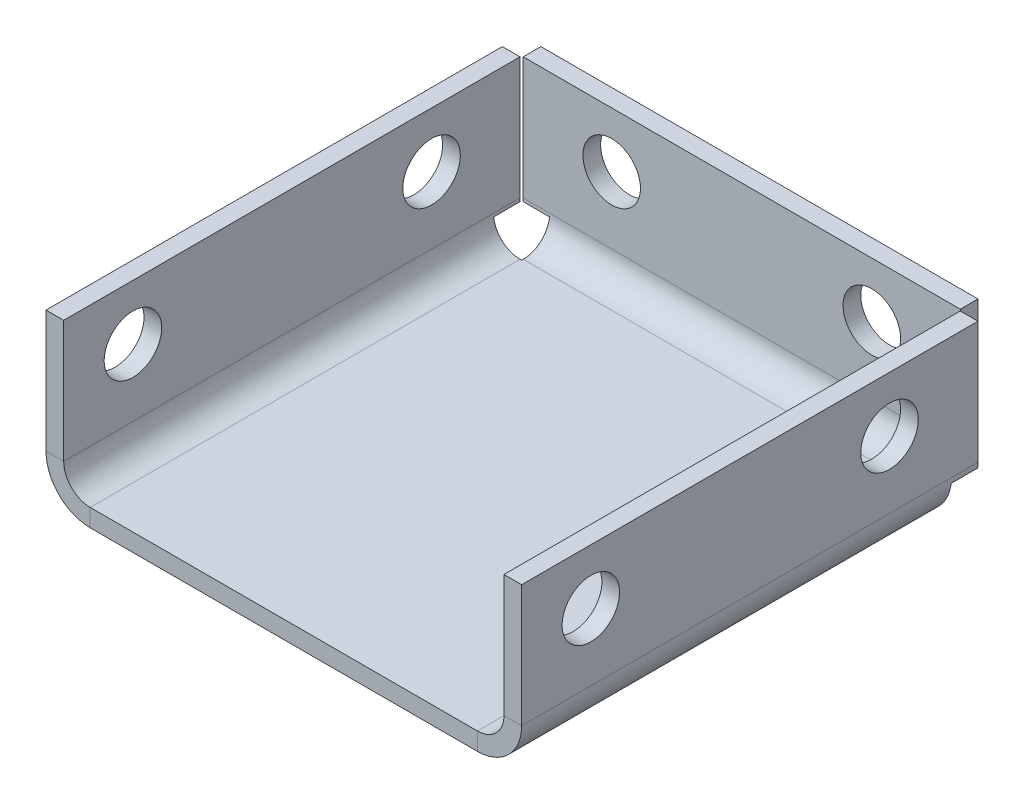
ISO-10303-21;
HEADER;
FILE_DESCRIPTION(('STEP AP214'),'2;1');
FILE_NAME('part.step','',(''),(''),'','','');
FILE_SCHEMA(('AUTOMOTIVE_DESIGN { 1 0 10303 214 1 1 1 1 }'));
ENDSEC;
DATA;
#1=APPLICATION_CONTEXT('core data for automotive mechanical design processes');
#2=APPLICATION_PROTOCOL_DEFINITION('international standard','automotive_design',2000,#1);
#3=PRODUCT_CONTEXT('',#1,'mechanical');
#4=PRODUCT('Part','Part','',(#3));
#5=PRODUCT_RELATED_PRODUCT_CATEGORY('part','',(#4));
#6=PRODUCT_DEFINITION_FORMATION('','',#4);
#7=PRODUCT_DEFINITION_CONTEXT('part definition',#1,'design');
#8=PRODUCT_DEFINITION('design','',#6,#7);
#9=PRODUCT_DEFINITION_SHAPE('','',#8);
#10=(LENGTH_UNIT() NAMED_UNIT(*) SI_UNIT(.MILLI.,.METRE.));
#11=(NAMED_UNIT(*) PLANE_ANGLE_UNIT() SI_UNIT($,.RADIAN.));
#12=(NAMED_UNIT(*) SI_UNIT($,.STERADIAN.) SOLID_ANGLE_UNIT());
#13=UNCERTAINTY_MEASURE_WITH_UNIT(LENGTH_MEASURE(1.E-05),#10,'distance_accuracy_value','');
#14=(GEOMETRIC_REPRESENTATION_CONTEXT(3) GLOBAL_UNCERTAINTY_ASSIGNED_CONTEXT((#13)) GLOBAL_UNIT_ASSIGNED_CONTEXT((#10,
#11,#12)) REPRESENTATION_CONTEXT('',''));
#15=CARTESIAN_POINT('',(0.,0.,0.));
#16=DIRECTION('',(0.,0.,1.));
#17=DIRECTION('',(1.,0.,0.));
#18=AXIS2_PLACEMENT_3D('',#15,#16,#17);
#19=CARTESIAN_POINT('',(0.,-7.37814230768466E-13,-215.));
#20=DIRECTION('',(0.,0.,1.));
#21=DIRECTION('',(0.,-1.,0.));
#22=AXIS2_PLACEMENT_3D('',#19,#20,#21);
#23=PLANE('',#22);
#24=DIRECTION('',(0.,-1.,0.));
#25=VECTOR('',#24,1.);
#26=CARTESIAN_POINT('',(-8.70710678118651,0.,-215.));
#27=LINE('',#26,#25);
#28=CARTESIAN_POINT('',(-8.70710678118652,11.9999999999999,-215.));
#29=VERTEX_POINT('',#28);
#30=CARTESIAN_POINT('',(-8.70710678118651,67.25,-215.));
#31=VERTEX_POINT('',#30);
#32=EDGE_CURVE('E338',#29,#31,#27,.F.);
#33=ORIENTED_EDGE('',*,*,#32,.F.);
#34=DIRECTION('',(-1.,0.,0.));
#35=VECTOR('',#34,1.);
#36=CARTESIAN_POINT('',(0.,12.,-215.));
#37=LINE('',#36,#35);
#38=CARTESIAN_POINT('',(-206.292893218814,12.0000000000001,-215.));
#39=VERTEX_POINT('',#38);
#40=EDGE_CURVE('E350',#39,#29,#37,.F.);
#41=ORIENTED_EDGE('',*,*,#40,.F.);
#42=DIRECTION('',(0.,1.,0.));
#43=VECTOR('',#42,1.);
#44=CARTESIAN_POINT('',(-206.292893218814,-7.37814230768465E-13,-215.));
#45=LINE('',#44,#43);
#46=CARTESIAN_POINT('',(-206.292893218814,67.25,-215.));
#47=VERTEX_POINT('',#46);
#48=EDGE_CURVE('E663',#39,#47,#45,.T.);
#49=ORIENTED_EDGE('',*,*,#48,.T.);
#50=DIRECTION('',(1.,0.,0.));
#51=VECTOR('',#50,1.);
#52=CARTESIAN_POINT('',(0.,67.25,-215.));
#53=LINE('',#52,#51);
#54=EDGE_CURVE('E651',#47,#31,#53,.T.);
#55=ORIENTED_EDGE('',*,*,#54,.T.);
#56=EDGE_LOOP('',(#33,#41,#49,#55));
#57=FACE_BOUND('',#56,.T.);
#58=CARTESIAN_POINT('',(-166.292893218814,42.25,-215.));
#59=DIRECTION('',(0.,0.,-1.));
#60=DIRECTION('',(0.,1.,0.));
#61=AXIS2_PLACEMENT_3D('',#58,#59,#60);
#62=CIRCLE('',#61,13.);
#63=CARTESIAN_POINT('',(-166.292893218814,55.25,-215.));
#64=VERTEX_POINT('',#63);
#65=EDGE_CURVE('E764',#64,#64,#62,.F.);
#66=ORIENTED_EDGE('',*,*,#65,.T.);
#67=EDGE_LOOP('',(#66));
#68=FACE_BOUND('',#67,.T.);
#69=CARTESIAN_POINT('',(-48.7071067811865,42.25,-215.));
#70=DIRECTION('',(0.,0.,-1.));
#71=DIRECTION('',(0.,1.,0.));
#72=AXIS2_PLACEMENT_3D('',#69,#70,#71);
#73=CIRCLE('',#72,13.);
#74=CARTESIAN_POINT('',(-48.7071067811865,55.25,-215.));
#75=VERTEX_POINT('',#74);
#76=EDGE_CURVE('E758',#75,#75,#73,.T.);
#77=ORIENTED_EDGE('',*,*,#76,.F.);
#78=EDGE_LOOP('',(#77));
#79=FACE_BOUND('',#78,.T.);
#80=ADVANCED_FACE('F140',(#57,#68,#79),#23,.F.);
#81=CARTESIAN_POINT('',(0.,-7.0988238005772E-13,-207.));
#82=DIRECTION('',(0.,0.,1.));
#83=DIRECTION('',(0.,-1.,0.));
#84=AXIS2_PLACEMENT_3D('',#81,#82,#83);
#85=PLANE('',#84);
#86=CARTESIAN_POINT('',(-166.292893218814,42.25,-207.));
#87=DIRECTION('',(0.,0.,1.));
#88=DIRECTION('',(0.,-1.,0.));
#89=AXIS2_PLACEMENT_3D('',#86,#87,#88);
#90=CIRCLE('',#89,13.);
#91=CARTESIAN_POINT('',(-166.292893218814,29.2500000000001,-207.));
#92=VERTEX_POINT('',#91);
#93=EDGE_CURVE('E756',#92,#92,#90,.F.);
#94=ORIENTED_EDGE('',*,*,#93,.T.);
#95=EDGE_LOOP('',(#94));
#96=FACE_BOUND('',#95,.T.);
#97=DIRECTION('',(-1.,0.,0.));
#98=VECTOR('',#97,1.);
#99=CARTESIAN_POINT('',(0.,12.,-207.));
#100=LINE('',#99,#98);
#101=CARTESIAN_POINT('',(-8.70710678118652,11.9999999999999,-207.));
#102=VERTEX_POINT('',#101);
#103=CARTESIAN_POINT('',(-206.292893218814,12.0000000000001,-207.));
#104=VERTEX_POINT('',#103);
#105=EDGE_CURVE('E342',#102,#104,#100,.T.);
#106=ORIENTED_EDGE('',*,*,#105,.F.);
#107=DIRECTION('',(0.,1.,0.));
#108=VECTOR('',#107,1.);
#109=CARTESIAN_POINT('',(-8.70710678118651,-7.0988238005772E-13,-207.));
#110=LINE('',#109,#108);
#111=CARTESIAN_POINT('',(-8.70710678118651,67.25,-207.));
#112=VERTEX_POINT('',#111);
#113=EDGE_CURVE('E327',#102,#112,#110,.T.);
#114=ORIENTED_EDGE('',*,*,#113,.T.);
#115=DIRECTION('',(-1.,0.,0.));
#116=VECTOR('',#115,1.);
#117=CARTESIAN_POINT('',(0.,67.25,-207.));
#118=LINE('',#117,#116);
#119=CARTESIAN_POINT('',(-206.292893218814,67.25,-207.));
#120=VERTEX_POINT('',#119);
#121=EDGE_CURVE('E655',#120,#112,#118,.F.);
#122=ORIENTED_EDGE('',*,*,#121,.F.);
#123=DIRECTION('',(0.,-1.,0.));
#124=VECTOR('',#123,1.);
#125=CARTESIAN_POINT('',(-206.292893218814,0.,-207.));
#126=LINE('',#125,#124);
#127=EDGE_CURVE('E345',#104,#120,#126,.F.);
#128=ORIENTED_EDGE('',*,*,#127,.F.);
#129=EDGE_LOOP('',(#106,#114,#122,#128));
#130=FACE_BOUND('',#129,.T.);
#131=CARTESIAN_POINT('',(-48.7071067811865,42.25,-207.));
#132=DIRECTION('',(0.,0.,1.));
#133=DIRECTION('',(0.,-1.,0.));
#134=AXIS2_PLACEMENT_3D('',#131,#132,#133);
#135=CIRCLE('',#134,13.);
#136=CARTESIAN_POINT('',(-48.7071067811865,29.25,-207.));
#137=VERTEX_POINT('',#136);
#138=EDGE_CURVE('E144',#137,#137,#135,.T.);
#139=ORIENTED_EDGE('',*,*,#138,.F.);
#140=EDGE_LOOP('',(#139));
#141=FACE_BOUND('',#140,.T.);
#142=ADVANCED_FACE('F343',(#96,#130,#141),#85,.T.);
#143=CARTESIAN_POINT('',(-215.,-7.37814230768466E-13,0.));
#144=DIRECTION('',(1.,0.,0.));
#145=DIRECTION('',(0.,1.,0.));
#146=AXIS2_PLACEMENT_3D('',#143,#144,#145);
#147=PLANE('',#146);
#148=DIRECTION('',(0.,-1.,0.));
#149=VECTOR('',#148,1.);
#150=CARTESIAN_POINT('',(-215.,0.,-206.292893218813));
#151=LINE('',#150,#149);
#152=CARTESIAN_POINT('',(-215.,11.9999999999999,-206.292893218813));
#153=VERTEX_POINT('',#152);
#154=CARTESIAN_POINT('',(-215.,67.25,-206.292893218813));
#155=VERTEX_POINT('',#154);
#156=EDGE_CURVE('E732',#153,#155,#151,.F.);
#157=ORIENTED_EDGE('',*,*,#156,.F.);
#158=DIRECTION('',(0.,0.,1.));
#159=VECTOR('',#158,1.);
#160=CARTESIAN_POINT('',(-215.,11.9999999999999,-215.));
#161=LINE('',#160,#159);
#162=CARTESIAN_POINT('',(-215.,11.9999999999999,0.));
#163=VERTEX_POINT('',#162);
#164=EDGE_CURVE('E721',#163,#153,#161,.F.);
#165=ORIENTED_EDGE('',*,*,#164,.F.);
#166=DIRECTION('',(0.,1.,0.));
#167=VECTOR('',#166,1.);
#168=CARTESIAN_POINT('',(-215.,-7.37814230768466E-13,0.));
#169=LINE('',#168,#167);
#170=CARTESIAN_POINT('',(-215.,67.25,0.));
#171=VERTEX_POINT('',#170);
#172=EDGE_CURVE('E714',#163,#171,#169,.T.);
#173=ORIENTED_EDGE('',*,*,#172,.T.);
#174=DIRECTION('',(0.,0.,-1.));
#175=VECTOR('',#174,1.);
#176=CARTESIAN_POINT('',(-215.,67.25,0.));
#177=LINE('',#176,#175);
#178=EDGE_CURVE('E711',#171,#155,#177,.T.);
#179=ORIENTED_EDGE('',*,*,#178,.T.);
#180=EDGE_LOOP('',(#157,#165,#173,#179));
#181=FACE_BOUND('',#180,.T.);
#182=CARTESIAN_POINT('',(-215.,42.25,-31.2928932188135));
#183=DIRECTION('',(-1.,0.,0.));
#184=DIRECTION('',(0.,-1.,0.));
#185=AXIS2_PLACEMENT_3D('',#182,#183,#184);
#186=CIRCLE('',#185,13.);
#187=CARTESIAN_POINT('',(-215.,29.25,-31.2928932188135));
#188=VERTEX_POINT('',#187);
#189=EDGE_CURVE('E762',#188,#188,#186,.F.);
#190=ORIENTED_EDGE('',*,*,#189,.T.);
#191=EDGE_LOOP('',(#190));
#192=FACE_BOUND('',#191,.T.);
#193=CARTESIAN_POINT('',(-215.,42.25,-166.292893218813));
#194=DIRECTION('',(-1.,0.,0.));
#195=DIRECTION('',(0.,-1.,0.));
#196=AXIS2_PLACEMENT_3D('',#193,#194,#195);
#197=CIRCLE('',#196,13.);
#198=CARTESIAN_POINT('',(-215.,29.25,-166.292893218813));
#199=VERTEX_POINT('',#198);
#200=EDGE_CURVE('E773',#199,#199,#197,.T.);
#201=ORIENTED_EDGE('',*,*,#200,.F.);
#202=EDGE_LOOP('',(#201));
#203=FACE_BOUND('',#202,.T.);
#204=ADVANCED_FACE('F793',(#181,#192,#203),#147,.F.);
#205=CARTESIAN_POINT('',(-207.,-7.0988238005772E-13,0.));
#206=DIRECTION('',(1.,0.,0.));
#207=DIRECTION('',(0.,1.,0.));
#208=AXIS2_PLACEMENT_3D('',#205,#206,#207);
#209=PLANE('',#208);
#210=CARTESIAN_POINT('',(-207.,42.25,-31.2928932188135));
#211=DIRECTION('',(1.,0.,0.));
#212=DIRECTION('',(0.,1.,0.));
#213=AXIS2_PLACEMENT_3D('',#210,#211,#212);
#214=CIRCLE('',#213,13.);
#215=CARTESIAN_POINT('',(-207.,55.2500000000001,-31.2928932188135));
#216=VERTEX_POINT('',#215);
#217=EDGE_CURVE('E752',#216,#216,#214,.F.);
#218=ORIENTED_EDGE('',*,*,#217,.T.);
#219=EDGE_LOOP('',(#218));
#220=FACE_BOUND('',#219,.T.);
#221=DIRECTION('',(0.,0.,1.));
#222=VECTOR('',#221,1.);
#223=CARTESIAN_POINT('',(-207.,12.,-215.));
#224=LINE('',#223,#222);
#225=CARTESIAN_POINT('',(-207.,12.,-206.292893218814));
#226=VERTEX_POINT('',#225);
#227=CARTESIAN_POINT('',(-207.,12.,0.));
#228=VERTEX_POINT('',#227);
#229=EDGE_CURVE('E727',#226,#228,#224,.T.);
#230=ORIENTED_EDGE('',*,*,#229,.F.);
#231=DIRECTION('',(0.,1.,0.));
#232=VECTOR('',#231,1.);
#233=CARTESIAN_POINT('',(-207.,-6.97250583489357E-13,-206.292893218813));
#234=LINE('',#233,#232);
#235=CARTESIAN_POINT('',(-207.,67.25,-206.292893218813));
#236=VERTEX_POINT('',#235);
#237=EDGE_CURVE('E706',#226,#236,#234,.T.);
#238=ORIENTED_EDGE('',*,*,#237,.T.);
#239=DIRECTION('',(0.,0.,1.));
#240=VECTOR('',#239,1.);
#241=CARTESIAN_POINT('',(-207.,67.25,-215.));
#242=LINE('',#241,#240);
#243=CARTESIAN_POINT('',(-207.,67.25,0.));
#244=VERTEX_POINT('',#243);
#245=EDGE_CURVE('E716',#244,#236,#242,.F.);
#246=ORIENTED_EDGE('',*,*,#245,.F.);
#247=DIRECTION('',(0.,-1.,0.));
#248=VECTOR('',#247,1.);
#249=CARTESIAN_POINT('',(-207.,67.25,0.));
#250=LINE('',#249,#248);
#251=EDGE_CURVE('E719',#228,#244,#250,.F.);
#252=ORIENTED_EDGE('',*,*,#251,.F.);
#253=EDGE_LOOP('',(#230,#238,#246,#252));
#254=FACE_BOUND('',#253,.T.);
#255=CARTESIAN_POINT('',(-207.,42.25,-166.292893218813));
#256=DIRECTION('',(1.,0.,0.));
#257=DIRECTION('',(0.,1.,0.));
#258=AXIS2_PLACEMENT_3D('',#255,#256,#257);
#259=CIRCLE('',#258,13.);
#260=CARTESIAN_POINT('',(-207.,55.25,-166.292893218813));
#261=VERTEX_POINT('',#260);
#262=EDGE_CURVE('E375',#261,#261,#259,.T.);
#263=ORIENTED_EDGE('',*,*,#262,.F.);
#264=EDGE_LOOP('',(#263));
#265=FACE_BOUND('',#264,.T.);
#266=ADVANCED_FACE('F783',(#220,#254,#265),#209,.T.);
#267=CARTESIAN_POINT('',(0.,0.,0.));
#268=DIRECTION('',(-1.,0.,0.));
#269=DIRECTION('',(0.,-1.,0.));
#270=AXIS2_PLACEMENT_3D('',#267,#268,#269);
#271=PLANE('',#270);
#272=DIRECTION('',(0.,0.,-1.));
#273=VECTOR('',#272,1.);
#274=CARTESIAN_POINT('',(0.,11.9999999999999,0.));
#275=LINE('',#274,#273);
#276=CARTESIAN_POINT('',(0.,11.9999999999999,-206.292893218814));
#277=VERTEX_POINT('',#276);
#278=CARTESIAN_POINT('',(0.,11.9999999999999,0.));
#279=VERTEX_POINT('',#278);
#280=EDGE_CURVE('E683',#277,#279,#275,.F.);
#281=ORIENTED_EDGE('',*,*,#280,.F.);
#282=DIRECTION('',(0.,1.,0.));
#283=VECTOR('',#282,1.);
#284=CARTESIAN_POINT('',(0.,0.,-206.292893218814));
#285=LINE('',#284,#283);
#286=CARTESIAN_POINT('',(2.34802120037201E-13,67.25,-206.292893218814));
#287=VERTEX_POINT('',#286);
#288=EDGE_CURVE('E693',#277,#287,#285,.T.);
#289=ORIENTED_EDGE('',*,*,#288,.T.);
#290=DIRECTION('',(0.,0.,1.));
#291=VECTOR('',#290,1.);
#292=CARTESIAN_POINT('',(2.34802120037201E-13,67.25,0.));
#293=LINE('',#292,#291);
#294=CARTESIAN_POINT('',(2.34802120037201E-13,67.25,0.));
#295=VERTEX_POINT('',#294);
#296=EDGE_CURVE('E673',#287,#295,#293,.T.);
#297=ORIENTED_EDGE('',*,*,#296,.T.);
#298=DIRECTION('',(0.,-1.,0.));
#299=VECTOR('',#298,1.);
#300=CARTESIAN_POINT('',(0.,0.,0.));
#301=LINE('',#300,#299);
#302=EDGE_CURVE('E675',#295,#279,#301,.T.);
#303=ORIENTED_EDGE('',*,*,#302,.T.);
#304=EDGE_LOOP('',(#281,#289,#297,#303));
#305=FACE_BOUND('',#304,.T.);
#306=CARTESIAN_POINT('',(3.05311331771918E-13,42.2500000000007,-31.2928932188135));
#307=DIRECTION('',(-1.,0.,0.));
#308=DIRECTION('',(0.,-1.,0.));
#309=AXIS2_PLACEMENT_3D('',#306,#307,#308);
#310=CIRCLE('',#309,13.);
#311=CARTESIAN_POINT('',(3.48717306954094E-13,29.2500000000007,-31.2928932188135));
#312=VERTEX_POINT('',#311);
#313=EDGE_CURVE('E776',#312,#312,#310,.F.);
#314=ORIENTED_EDGE('',*,*,#313,.F.);
#315=EDGE_LOOP('',(#314));
#316=FACE_BOUND('',#315,.T.);
#317=CARTESIAN_POINT('',(3.05311331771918E-13,42.2500000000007,-166.292893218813));
#318=DIRECTION('',(-1.,0.,0.));
#319=DIRECTION('',(0.,-1.,0.));
#320=AXIS2_PLACEMENT_3D('',#317,#318,#319);
#321=CIRCLE('',#320,13.);
#322=CARTESIAN_POINT('',(3.48717306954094E-13,29.2500000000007,-166.292893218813));
#323=VERTEX_POINT('',#322);
#324=EDGE_CURVE('E753',#323,#323,#321,.T.);
#325=ORIENTED_EDGE('',*,*,#324,.T.);
#326=EDGE_LOOP('',(#325));
#327=FACE_BOUND('',#326,.T.);
#328=ADVANCED_FACE('F839',(#305,#316,#327),#271,.F.);
#329=CARTESIAN_POINT('',(-8.,0.,0.));
#330=DIRECTION('',(-1.,0.,0.));
#331=DIRECTION('',(0.,-1.,0.));
#332=AXIS2_PLACEMENT_3D('',#329,#330,#331);
#333=PLANE('',#332);
#334=CARTESIAN_POINT('',(-7.99999999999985,42.2500000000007,-31.2928932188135));
#335=DIRECTION('',(-1.,0.,0.));
#336=DIRECTION('',(0.,-1.,0.));
#337=AXIS2_PLACEMENT_3D('',#334,#335,#336);
#338=CIRCLE('',#337,13.);
#339=CARTESIAN_POINT('',(-7.9999999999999,29.2500000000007,-31.2928932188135));
#340=VERTEX_POINT('',#339);
#341=EDGE_CURVE('E749',#340,#340,#338,.F.);
#342=ORIENTED_EDGE('',*,*,#341,.T.);
#343=EDGE_LOOP('',(#342));
#344=FACE_BOUND('',#343,.T.);
#345=DIRECTION('',(0.,-1.,0.));
#346=VECTOR('',#345,1.);
#347=CARTESIAN_POINT('',(-8.,0.,-206.292893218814));
#348=LINE('',#347,#346);
#349=CARTESIAN_POINT('',(-7.99999999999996,12.,-206.292893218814));
#350=VERTEX_POINT('',#349);
#351=CARTESIAN_POINT('',(-7.99999999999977,67.25,-206.292893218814));
#352=VERTEX_POINT('',#351);
#353=EDGE_CURVE('E669',#350,#352,#348,.F.);
#354=ORIENTED_EDGE('',*,*,#353,.F.);
#355=DIRECTION('',(0.,0.,-1.));
#356=VECTOR('',#355,1.);
#357=CARTESIAN_POINT('',(-7.99999999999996,12.,0.));
#358=LINE('',#357,#356);
#359=CARTESIAN_POINT('',(-7.99999999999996,12.,0.));
#360=VERTEX_POINT('',#359);
#361=EDGE_CURVE('E685',#360,#350,#358,.T.);
#362=ORIENTED_EDGE('',*,*,#361,.F.);
#363=DIRECTION('',(0.,1.,0.));
#364=VECTOR('',#363,1.);
#365=CARTESIAN_POINT('',(-8.,0.,0.));
#366=LINE('',#365,#364);
#367=CARTESIAN_POINT('',(-7.99999999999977,67.25,0.));
#368=VERTEX_POINT('',#367);
#369=EDGE_CURVE('E680',#368,#360,#366,.F.);
#370=ORIENTED_EDGE('',*,*,#369,.F.);
#371=DIRECTION('',(0.,0.,-1.));
#372=VECTOR('',#371,1.);
#373=CARTESIAN_POINT('',(-7.99999999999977,67.25,0.));
#374=LINE('',#373,#372);
#375=EDGE_CURVE('E678',#352,#368,#374,.F.);
#376=ORIENTED_EDGE('',*,*,#375,.F.);
#377=EDGE_LOOP('',(#354,#362,#370,#376));
#378=FACE_BOUND('',#377,.T.);
#379=CARTESIAN_POINT('',(-7.99999999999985,42.2500000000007,-166.292893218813));
#380=DIRECTION('',(-1.,0.,0.));
#381=DIRECTION('',(0.,-1.,0.));
#382=AXIS2_PLACEMENT_3D('',#379,#380,#381);
#383=CIRCLE('',#382,13.);
#384=CARTESIAN_POINT('',(-7.9999999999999,29.2500000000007,-166.292893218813));
#385=VERTEX_POINT('',#384);
#386=EDGE_CURVE('E754',#385,#385,#383,.T.);
#387=ORIENTED_EDGE('',*,*,#386,.F.);
#388=EDGE_LOOP('',(#387));
#389=FACE_BOUND('',#388,.T.);
#390=ADVANCED_FACE('F842',(#344,#378,#389),#333,.T.);
#391=CARTESIAN_POINT('',(0.,-8.,0.));
#392=DIRECTION('',(0.,1.,0.));
#393=DIRECTION('',(0.,0.,1.));
#394=AXIS2_PLACEMENT_3D('',#391,#392,#393);
#395=PLANE('',#394);
#396=DIRECTION('',(-1.,0.,0.));
#397=VECTOR('',#396,1.);
#398=CARTESIAN_POINT('',(-206.292893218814,-8.00000000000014,-195.));
#399=LINE('',#398,#397);
#400=CARTESIAN_POINT('',(-194.292893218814,-8.00000000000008,-195.));
#401=VERTEX_POINT('',#400);
#402=CARTESIAN_POINT('',(-20.7071067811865,-8.00000000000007,-195.));
#403=VERTEX_POINT('',#402);
#404=EDGE_CURVE('E667',#401,#403,#399,.F.);
#405=ORIENTED_EDGE('',*,*,#404,.T.);
#406=DIRECTION('',(0.,0.,-1.));
#407=VECTOR('',#406,1.);
#408=CARTESIAN_POINT('',(-20.7071067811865,-8.,0.));
#409=LINE('',#408,#407);
#410=CARTESIAN_POINT('',(-20.7071067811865,-8.,-194.292893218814));
#411=VERTEX_POINT('',#410);
#412=EDGE_CURVE('E425',#411,#403,#409,.T.);
#413=ORIENTED_EDGE('',*,*,#412,.F.);
#414=DIRECTION('',(1.,0.,0.));
#415=VECTOR('',#414,1.);
#416=CARTESIAN_POINT('',(0.,-8.,-194.292893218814));
#417=LINE('',#416,#415);
#418=CARTESIAN_POINT('',(-20.,-8.,-194.292893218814));
#419=VERTEX_POINT('',#418);
#420=EDGE_CURVE('E433',#419,#411,#417,.F.);
#421=ORIENTED_EDGE('',*,*,#420,.F.);
#422=DIRECTION('',(0.,0.,-1.));
#423=VECTOR('',#422,1.);
#424=CARTESIAN_POINT('',(-20.,-8.,-206.292893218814));
#425=LINE('',#424,#423);
#426=CARTESIAN_POINT('',(-20.,-8.,0.));
#427=VERTEX_POINT('',#426);
#428=EDGE_CURVE('E157',#419,#427,#425,.F.);
#429=ORIENTED_EDGE('',*,*,#428,.T.);
#430=DIRECTION('',(1.,0.,0.));
#431=VECTOR('',#430,1.);
#432=CARTESIAN_POINT('',(0.,-8.,0.));
#433=LINE('',#432,#431);
#434=CARTESIAN_POINT('',(-195.,-8.00000000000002,0.));
#435=VERTEX_POINT('',#434);
#436=EDGE_CURVE('E15',#435,#427,#433,.T.);
#437=ORIENTED_EDGE('',*,*,#436,.F.);
#438=DIRECTION('',(0.,0.,1.));
#439=VECTOR('',#438,1.);
#440=CARTESIAN_POINT('',(-195.,-8.00000000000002,0.));
#441=LINE('',#440,#439);
#442=CARTESIAN_POINT('',(-195.,-8.00000000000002,-194.292893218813));
#443=VERTEX_POINT('',#442);
#444=EDGE_CURVE('E738',#435,#443,#441,.F.);
#445=ORIENTED_EDGE('',*,*,#444,.T.);
#446=DIRECTION('',(1.,0.,0.));
#447=VECTOR('',#446,1.);
#448=CARTESIAN_POINT('',(0.,-8.00000000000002,-194.292893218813));
#449=LINE('',#448,#447);
#450=CARTESIAN_POINT('',(-194.292893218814,-8.00000000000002,-194.292893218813));
#451=VERTEX_POINT('',#450);
#452=EDGE_CURVE('E567',#451,#443,#449,.F.);
#453=ORIENTED_EDGE('',*,*,#452,.F.);
#454=DIRECTION('',(0.,0.,-1.));
#455=VECTOR('',#454,1.);
#456=CARTESIAN_POINT('',(-194.292893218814,-8.00000000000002,0.));
#457=LINE('',#456,#455);
#458=EDGE_CURVE('E575',#401,#451,#457,.F.);
#459=ORIENTED_EDGE('',*,*,#458,.F.);
#460=EDGE_LOOP('',(#405,#413,#421,#429,#437,#445,#453,#459));
#461=FACE_BOUND('',#460,.T.);
#462=ADVANCED_FACE('F846',(#461),#395,.F.);
#463=CARTESIAN_POINT('',(0.,0.,0.));
#464=DIRECTION('',(0.,1.,0.));
#465=DIRECTION('',(0.,0.,1.));
#466=AXIS2_PLACEMENT_3D('',#463,#464,#465);
#467=PLANE('',#466);
#468=DIRECTION('',(0.,0.,-1.));
#469=VECTOR('',#468,1.);
#470=CARTESIAN_POINT('',(-20.,0.,-206.292893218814));
#471=LINE('',#470,#469);
#472=CARTESIAN_POINT('',(-20.,0.,-194.292893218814));
#473=VERTEX_POINT('',#472);
#474=CARTESIAN_POINT('',(-20.,0.,0.));
#475=VERTEX_POINT('',#474);
#476=EDGE_CURVE('E164',#473,#475,#471,.F.);
#477=ORIENTED_EDGE('',*,*,#476,.F.);
#478=DIRECTION('',(1.,0.,0.));
#479=VECTOR('',#478,1.);
#480=CARTESIAN_POINT('',(0.,0.,-194.292893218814));
#481=LINE('',#480,#479);
#482=CARTESIAN_POINT('',(-20.7071067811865,0.,-194.292893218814));
#483=VERTEX_POINT('',#482);
#484=EDGE_CURVE('E366',#473,#483,#481,.F.);
#485=ORIENTED_EDGE('',*,*,#484,.T.);
#486=DIRECTION('',(0.,0.,-1.));
#487=VECTOR('',#486,1.);
#488=CARTESIAN_POINT('',(-20.7071067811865,0.,0.));
#489=LINE('',#488,#487);
#490=CARTESIAN_POINT('',(-20.7071067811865,-1.38777878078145E-13,-195.));
#491=VERTEX_POINT('',#490);
#492=EDGE_CURVE('E359',#483,#491,#489,.T.);
#493=ORIENTED_EDGE('',*,*,#492,.T.);
#494=DIRECTION('',(-1.,0.,0.));
#495=VECTOR('',#494,1.);
#496=CARTESIAN_POINT('',(-206.292893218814,-1.38777878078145E-13,-195.));
#497=LINE('',#496,#495);
#498=CARTESIAN_POINT('',(-194.292893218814,-1.38777878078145E-13,-195.));
#499=VERTEX_POINT('',#498);
#500=EDGE_CURVE('E654',#499,#491,#497,.F.);
#501=ORIENTED_EDGE('',*,*,#500,.F.);
#502=DIRECTION('',(0.,0.,-1.));
#503=VECTOR('',#502,1.);
#504=CARTESIAN_POINT('',(-194.292893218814,0.,0.));
#505=LINE('',#504,#503);
#506=CARTESIAN_POINT('',(-194.292893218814,0.,-194.292893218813));
#507=VERTEX_POINT('',#506);
#508=EDGE_CURVE('E512',#499,#507,#505,.F.);
#509=ORIENTED_EDGE('',*,*,#508,.T.);
#510=DIRECTION('',(1.,0.,0.));
#511=VECTOR('',#510,1.);
#512=CARTESIAN_POINT('',(0.,0.,-194.292893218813));
#513=LINE('',#512,#511);
#514=CARTESIAN_POINT('',(-195.,0.,-194.292893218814));
#515=VERTEX_POINT('',#514);
#516=EDGE_CURVE('E535',#507,#515,#513,.F.);
#517=ORIENTED_EDGE('',*,*,#516,.T.);
#518=DIRECTION('',(0.,0.,1.));
#519=VECTOR('',#518,1.);
#520=CARTESIAN_POINT('',(-195.,0.,0.));
#521=LINE('',#520,#519);
#522=CARTESIAN_POINT('',(-195.,0.,0.));
#523=VERTEX_POINT('',#522);
#524=EDGE_CURVE('E739',#523,#515,#521,.F.);
#525=ORIENTED_EDGE('',*,*,#524,.F.);
#526=DIRECTION('',(1.,0.,0.));
#527=VECTOR('',#526,1.);
#528=CARTESIAN_POINT('',(0.,0.,0.));
#529=LINE('',#528,#527);
#530=EDGE_CURVE('E149',#523,#475,#529,.T.);
#531=ORIENTED_EDGE('',*,*,#530,.T.);
#532=EDGE_LOOP('',(#477,#485,#493,#501,#509,#517,#525,#531));
#533=FACE_BOUND('',#532,.T.);
#534=ADVANCED_FACE('F893',(#533),#467,.T.);
#535=CARTESIAN_POINT('',(0.,-8.,0.));
#536=DIRECTION('',(0.,0.,1.));
#537=DIRECTION('',(1.,0.,0.));
#538=AXIS2_PLACEMENT_3D('',#535,#536,#537);
#539=PLANE('',#538);
#540=DIRECTION('',(0.,-1.,0.));
#541=VECTOR('',#540,1.);
#542=CARTESIAN_POINT('',(-20.,0.,0.));
#543=LINE('',#542,#541);
#544=EDGE_CURVE('E699',#475,#427,#543,.T.);
#545=ORIENTED_EDGE('',*,*,#544,.F.);
#546=ORIENTED_EDGE('',*,*,#530,.F.);
#547=DIRECTION('',(0.,-1.,0.));
#548=VECTOR('',#547,1.);
#549=CARTESIAN_POINT('',(-195.,0.,0.));
#550=LINE('',#549,#548);
#551=EDGE_CURVE('E744',#523,#435,#550,.T.);
#552=ORIENTED_EDGE('',*,*,#551,.T.);
#553=ORIENTED_EDGE('',*,*,#436,.T.);
#554=EDGE_LOOP('',(#545,#546,#552,#553));
#555=FACE_BOUND('',#554,.T.);
#556=ADVANCED_FACE('F142',(#555),#539,.T.);
#557=CARTESIAN_POINT('',(-195.,12.,0.));
#558=DIRECTION('',(0.,0.,-1.));
#559=DIRECTION('',(-1.,0.,0.));
#560=AXIS2_PLACEMENT_3D('',#557,#558,#559);
#561=PLANE('',#560);
#562=CARTESIAN_POINT('',(-195.,12.,0.));
#563=DIRECTION('',(0.,0.,1.));
#564=DIRECTION('',(1.,0.,0.));
#565=AXIS2_PLACEMENT_3D('',#562,#563,#564);
#566=CIRCLE('',#565,12.);
#567=EDGE_CURVE('E710',#228,#523,#566,.T.);
#568=ORIENTED_EDGE('',*,*,#567,.F.);
#569=DIRECTION('',(1.,0.,0.));
#570=VECTOR('',#569,1.);
#571=CARTESIAN_POINT('',(-207.,12.,0.));
#572=LINE('',#571,#570);
#573=EDGE_CURVE('E724',#228,#163,#572,.F.);
#574=ORIENTED_EDGE('',*,*,#573,.T.);
#575=CARTESIAN_POINT('',(-195.,12.,0.));
#576=DIRECTION('',(0.,0.,1.));
#577=DIRECTION('',(1.,0.,0.));
#578=AXIS2_PLACEMENT_3D('',#575,#576,#577);
#579=CIRCLE('',#578,20.);
#580=EDGE_CURVE('E735',#163,#435,#579,.T.);
#581=ORIENTED_EDGE('',*,*,#580,.T.);
#582=ORIENTED_EDGE('',*,*,#551,.F.);
#583=EDGE_LOOP('',(#568,#574,#581,#582));
#584=FACE_BOUND('',#583,.T.);
#585=ADVANCED_FACE('F884',(#584),#561,.F.);
#586=CARTESIAN_POINT('',(-195.,12.,0.));
#587=DIRECTION('',(0.,0.,1.));
#588=DIRECTION('',(-1.,0.,0.));
#589=AXIS2_PLACEMENT_3D('',#586,#587,#588);
#590=CYLINDRICAL_SURFACE('',#589,20.);
#591=ORIENTED_EDGE('',*,*,#164,.T.);
#592=CARTESIAN_POINT('',(-215.,11.9999999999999,-206.292893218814));
#593=CARTESIAN_POINT('',(-215.000000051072,11.9041745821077,-206.292893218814));
#594=CARTESIAN_POINT('',(-214.999311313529,11.8083491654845,-206.292893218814));
#595=CARTESIAN_POINT('',(-214.996556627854,11.6167181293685,-206.292893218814));
#596=CARTESIAN_POINT('',(-214.994490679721,11.5209125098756,-206.292893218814));
#597=CARTESIAN_POINT('',(-214.988981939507,11.3293408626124,-206.292893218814));
#598=CARTESIAN_POINT('',(-214.985539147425,11.2335748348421,-206.292893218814));
#599=CARTESIAN_POINT('',(-214.977277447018,11.0421021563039,-206.292893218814));
#600=CARTESIAN_POINT('',(-214.972458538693,10.9463955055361,-206.292893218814));
#601=CARTESIAN_POINT('',(-214.961445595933,10.7550613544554,-206.292893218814));
#602=CARTESIAN_POINT('',(-214.955251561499,10.6594338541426,-206.292893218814));
#603=CARTESIAN_POINT('',(-214.941489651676,10.4682777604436,-206.292893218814));
#604=CARTESIAN_POINT('',(-214.933921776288,10.3727491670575,-206.292893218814));
#605=CARTESIAN_POINT('',(-214.917413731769,10.1818106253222,-206.292893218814));
#606=CARTESIAN_POINT('',(-214.908473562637,10.0864006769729,-206.292893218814));
#607=CARTESIAN_POINT('',(-214.889222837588,9.89571913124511,-206.292893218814));
#608=CARTESIAN_POINT('',(-214.87891228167,9.80044753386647,-206.292893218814));
#609=CARTESIAN_POINT('',(-214.867917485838,9.70525496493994,-206.292893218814));
#610=B_SPLINE_CURVE_WITH_KNOTS('',3,(#592,#593,#594,#595,#596,#597,#598,#599,#600,#601,#602,
#603,#604,#605,#606,#607,#608,#609),.UNSPECIFIED.,.F.,.F.,(4,2,2,2,2,2,2,2,4),(0.,
0.287473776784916,0.574947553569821,0.862421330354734,1.14989510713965,1.43736888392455,
1.72484266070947,2.01231643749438,2.29979021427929),.UNSPECIFIED.);
#611=CARTESIAN_POINT('',(-214.867917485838,9.70525496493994,-206.292892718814));
#612=VERTEX_POINT('',#611);
#613=EDGE_CURVE('E578',#153,#612,#610,.T.);
#614=ORIENTED_EDGE('',*,*,#613,.T.);
#615=CARTESIAN_POINT('',(-214.867917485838,9.70525496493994,-206.292893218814));
#616=CARTESIAN_POINT('',(-214.867917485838,9.70525496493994,-205.792893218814));
#617=CARTESIAN_POINT('',(-214.867917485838,9.70525496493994,-205.292893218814));
#618=CARTESIAN_POINT('',(-214.867917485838,9.70525496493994,-204.292893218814));
#619=CARTESIAN_POINT('',(-214.867917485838,9.70525496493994,-203.792893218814));
#620=CARTESIAN_POINT('',(-214.867917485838,9.70525496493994,-202.792893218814));
#621=CARTESIAN_POINT('',(-214.867917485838,9.70525496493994,-202.292893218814));
#622=CARTESIAN_POINT('',(-214.867917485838,9.70525496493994,-201.292893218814));
#623=CARTESIAN_POINT('',(-214.867917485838,9.70525496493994,-200.792893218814));
#624=CARTESIAN_POINT('',(-214.867917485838,9.70525496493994,-199.792893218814));
#625=CARTESIAN_POINT('',(-214.867917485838,9.70525496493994,-199.292893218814));
#626=CARTESIAN_POINT('',(-214.867917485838,9.70525496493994,-198.292893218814));
#627=CARTESIAN_POINT('',(-214.867917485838,9.70525496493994,-197.792893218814));
#628=CARTESIAN_POINT('',(-214.867917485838,9.70525496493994,-196.792893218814));
#629=CARTESIAN_POINT('',(-214.867917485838,9.70525496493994,-196.292893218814));
#630=CARTESIAN_POINT('',(-214.867917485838,9.70525496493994,-195.292893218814));
#631=CARTESIAN_POINT('',(-214.867917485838,9.70525496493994,-194.792893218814));
#632=CARTESIAN_POINT('',(-214.867917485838,9.70525496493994,-194.292893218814));
#633=B_SPLINE_CURVE_WITH_KNOTS('',3,(#615,#616,#617,#618,#619,#620,#621,#622,#623,#624,#625,
#626,#627,#628,#629,#630,#631,#632),.UNSPECIFIED.,.F.,.F.,(4,2,2,2,2,2,2,2,4),(0.,1.5,3.,4.5,
6.00000000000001,7.50000000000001,9.00000000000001,10.5,12.),.UNSPECIFIED.);
#634=CARTESIAN_POINT('',(-214.867917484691,9.70525495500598,-194.292893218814));
#635=VERTEX_POINT('',#634);
#636=EDGE_CURVE('E582',#612,#635,#633,.T.);
#637=ORIENTED_EDGE('',*,*,#636,.T.);
#638=CARTESIAN_POINT('',(-214.867917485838,9.70525496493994,-194.292893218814));
#639=CARTESIAN_POINT('',(-214.833123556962,9.40396425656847,-194.292893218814));
#640=CARTESIAN_POINT('',(-214.791466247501,9.10346667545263,-194.292893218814));
#641=CARTESIAN_POINT('',(-214.694533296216,8.50467600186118,-194.292893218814));
#642=CARTESIAN_POINT('',(-214.639257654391,8.20638290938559,-194.292893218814));
#643=CARTESIAN_POINT('',(-214.515196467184,7.61261944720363,-194.292893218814));
#644=CARTESIAN_POINT('',(-214.446410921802,7.31714907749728,-194.292893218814));
#645=CARTESIAN_POINT('',(-214.295473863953,6.72964223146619,-194.292893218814));
#646=CARTESIAN_POINT('',(-214.213322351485,6.43760575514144,-194.292893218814));
#647=CARTESIAN_POINT('',(-214.035822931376,5.85757108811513,-194.292893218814));
#648=CARTESIAN_POINT('',(-213.940475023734,5.56957289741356,-194.292893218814));
#649=CARTESIAN_POINT('',(-213.73678023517,4.9982107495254,-194.292893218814));
#650=CARTESIAN_POINT('',(-213.628433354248,4.71484679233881,-194.292893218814));
#651=CARTESIAN_POINT('',(-213.398964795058,4.15333949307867,-194.292893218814));
#652=CARTESIAN_POINT('',(-213.27784311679,3.87519615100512,-194.292893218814));
#653=CARTESIAN_POINT('',(-213.023075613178,3.3247056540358,-194.292893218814));
#654=CARTESIAN_POINT('',(-212.889429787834,3.05235849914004,-194.292893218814));
#655=CARTESIAN_POINT('',(-212.609890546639,2.51402395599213,-194.292893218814));
#656=CARTESIAN_POINT('',(-212.463997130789,2.24803656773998,-194.292893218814));
#657=CARTESIAN_POINT('',(-212.160264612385,1.72297197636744,-194.292893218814));
#658=CARTESIAN_POINT('',(-212.002425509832,1.46389477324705,-194.292893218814));
#659=CARTESIAN_POINT('',(-211.675128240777,0.953186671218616,-194.292893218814));
#660=CARTESIAN_POINT('',(-211.505670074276,0.701555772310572,-194.292893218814));
#661=CARTESIAN_POINT('',(-211.155485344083,0.206260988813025,-194.292893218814));
#662=CARTESIAN_POINT('',(-210.974758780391,-0.037402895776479,-194.292893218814));
#663=CARTESIAN_POINT('',(-210.602411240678,-0.516259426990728,-194.292893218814));
#664=CARTESIAN_POINT('',(-210.410790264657,-0.751452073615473,-194.292893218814));
#665=CARTESIAN_POINT('',(-210.017050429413,-1.21287943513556,-194.292893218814));
#666=CARTESIAN_POINT('',(-209.814931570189,-1.4391141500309,-194.292893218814));
#667=CARTESIAN_POINT('',(-209.400614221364,-1.88215749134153,-194.292893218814));
#668=CARTESIAN_POINT('',(-209.188415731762,-2.09896611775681,-194.292893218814));
#669=CARTESIAN_POINT('',(-208.754378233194,-2.5227086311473,-194.292893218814));
#670=CARTESIAN_POINT('',(-208.532539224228,-2.7296425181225,-194.292893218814));
#671=CARTESIAN_POINT('',(-208.07967974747,-3.13320733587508,-194.292893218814));
#672=CARTESIAN_POINT('',(-207.848659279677,-3.32983826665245,-194.292893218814));
#673=CARTESIAN_POINT('',(-207.377914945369,-3.71239027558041,-194.292893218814));
#674=CARTESIAN_POINT('',(-207.138191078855,-3.898311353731,-194.292893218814));
#675=CARTESIAN_POINT('',(-206.650536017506,-4.25905892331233,-194.292893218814));
#676=CARTESIAN_POINT('',(-206.402604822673,-4.43388541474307,-194.292893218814));
#677=CARTESIAN_POINT('',(-205.899048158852,-4.77208203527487,-194.292893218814));
#678=CARTESIAN_POINT('',(-205.643422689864,-4.93545216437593,-194.292893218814));
#679=CARTESIAN_POINT('',(-205.125006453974,-5.25039799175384,-194.292893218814));
#680=CARTESIAN_POINT('',(-204.862215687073,-5.40197369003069,-194.292893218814));
#681=CARTESIAN_POINT('',(-204.33001265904,-5.69301699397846,-194.292893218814));
#682=CARTESIAN_POINT('',(-204.060600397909,-5.83248459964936,-194.292893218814));
#683=CARTESIAN_POINT('',(-203.515711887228,-6.09902311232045,-194.292893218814));
#684=CARTESIAN_POINT('',(-203.240235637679,-6.22609401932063,-194.292893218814));
#685=CARTESIAN_POINT('',(-202.683789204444,-6.46757618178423,-194.292893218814));
#686=CARTESIAN_POINT('',(-202.402819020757,-6.58198743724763,-194.292893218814));
#687=CARTESIAN_POINT('',(-201.835966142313,-6.79791354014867,-194.292893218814));
#688=CARTESIAN_POINT('',(-201.550083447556,-6.8994283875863,-194.292893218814));
#689=CARTESIAN_POINT('',(-200.973997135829,-7.08935160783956,-194.292893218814));
#690=CARTESIAN_POINT('',(-200.68379351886,-7.17775998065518,-194.292893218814));
#691=CARTESIAN_POINT('',(-200.099665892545,-7.34128729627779,-194.292893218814));
#692=CARTESIAN_POINT('',(-199.8057418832,-7.41640623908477,-194.292893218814));
#693=CARTESIAN_POINT('',(-199.214781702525,-7.55319927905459,-194.292893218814));
#694=CARTESIAN_POINT('',(-198.917745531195,-7.61487337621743,-194.292893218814));
#695=CARTESIAN_POINT('',(-198.321175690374,-7.72464898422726,-194.292893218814));
#696=CARTESIAN_POINT('',(-198.021642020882,-7.77275049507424,-194.292893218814));
#697=CARTESIAN_POINT('',(-197.420697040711,-7.85528182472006,-194.292893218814));
#698=CARTESIAN_POINT('',(-197.119285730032,-7.88971164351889,-194.292893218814));
#699=CARTESIAN_POINT('',(-196.515209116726,-7.94482672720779,-194.292893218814));
#700=CARTESIAN_POINT('',(-196.212543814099,-7.96551199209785,-194.292893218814));
#701=CARTESIAN_POINT('',(-195.606585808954,-7.99310118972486,-194.292893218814));
#702=CARTESIAN_POINT('',(-195.303293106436,-8.0000051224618,-194.292893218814));
#703=CARTESIAN_POINT('',(-195.,-8.00000000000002,-194.292893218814));
#704=B_SPLINE_CURVE_WITH_KNOTS('',3,(#638,#639,#640,#641,#642,#643,#644,#645,#646,#647,#648,
#649,#650,#651,#652,#653,#654,#655,#656,#657,#658,#659,#660,#661,#662,#663,#664,#665,#666,#667,
#668,#669,#670,#671,#672,#673,#674,#675,#676,#677,#678,#679,#680,#681,#682,#683,#684,#685,#686,
#687,#688,#689,#690,#691,#692,#693,#694,#695,#696,#697,#698,#699,#700,#701,#702,#703),
.UNSPECIFIED.,.F.,.F.,(4,2,2,2,2,2,2,2,2,2,2,2,2,2,2,2,2,2,2,2,2,2,2,2,2,2,2,2,2,2,2,2,4),(0.,
0.909800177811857,1.81960035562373,2.72940053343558,3.63920071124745,4.5490008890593,
5.45880106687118,6.36860124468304,7.27840142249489,8.18820160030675,9.09800177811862,
10.0078019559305,10.9176021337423,11.8274023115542,12.7372024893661,13.6470026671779,
14.5568028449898,15.4666030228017,16.3764032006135,17.2862033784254,18.1960035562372,
19.1058037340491,20.015603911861,20.9254040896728,21.8352042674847,22.7450044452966,
23.6548046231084,24.5646048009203,25.4744049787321,26.384205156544,27.2940053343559,
28.2038055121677,29.1136056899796),.UNSPECIFIED.);
#705=EDGE_CURVE('E596',#635,#443,#704,.T.);
#706=ORIENTED_EDGE('',*,*,#705,.T.);
#707=ORIENTED_EDGE('',*,*,#444,.F.);
#708=ORIENTED_EDGE('',*,*,#580,.F.);
#709=EDGE_LOOP('',(#591,#614,#637,#706,#707,#708));
#710=FACE_BOUND('',#709,.T.);
#711=ADVANCED_FACE('F881',(#710),#590,.T.);
#712=CARTESIAN_POINT('',(-195.,12.,0.));
#713=DIRECTION('',(0.,0.,1.));
#714=DIRECTION('',(-1.,0.,0.));
#715=AXIS2_PLACEMENT_3D('',#712,#713,#714);
#716=CYLINDRICAL_SURFACE('',#715,12.);
#717=ORIENTED_EDGE('',*,*,#524,.T.);
#718=CARTESIAN_POINT('',(-206.920750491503,10.623152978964,-194.292893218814));
#719=CARTESIAN_POINT('',(-206.899874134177,10.4423785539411,-194.292893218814));
#720=CARTESIAN_POINT('',(-206.874879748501,10.2620800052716,-194.292893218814));
#721=CARTESIAN_POINT('',(-206.816719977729,9.90280560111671,-194.292893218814));
#722=CARTESIAN_POINT('',(-206.783554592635,9.72382974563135,-194.292893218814));
#723=CARTESIAN_POINT('',(-206.70911788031,9.36757166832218,-194.292893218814));
#724=CARTESIAN_POINT('',(-206.667846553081,9.19028944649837,-194.292893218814));
#725=CARTESIAN_POINT('',(-206.577284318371,8.83778533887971,-194.292893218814));
#726=CARTESIAN_POINT('',(-206.527993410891,8.66256345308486,-194.292893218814));
#727=CARTESIAN_POINT('',(-206.421493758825,8.31454265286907,-194.292893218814));
#728=CARTESIAN_POINT('',(-206.36428501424,8.14174373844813,-194.292893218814));
#729=CARTESIAN_POINT('',(-206.242068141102,7.79892644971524,-194.292893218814));
#730=CARTESIAN_POINT('',(-206.177060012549,7.62890807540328,-194.292893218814));
#731=CARTESIAN_POINT('',(-206.039378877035,7.2920036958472,-194.292893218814));
#732=CARTESIAN_POINT('',(-205.966705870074,7.12511769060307,-194.292893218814));
#733=CARTESIAN_POINT('',(-205.813845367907,6.79482339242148,-194.292893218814));
#734=CARTESIAN_POINT('',(-205.7336578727,6.63141509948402,-194.292893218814));
#735=CARTESIAN_POINT('',(-205.565934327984,6.30841437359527,-194.292893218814));
#736=CARTESIAN_POINT('',(-205.478398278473,6.14882194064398,-194.292893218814));
#737=CARTESIAN_POINT('',(-205.296158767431,5.83378318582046,-194.292893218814));
#738=CARTESIAN_POINT('',(-205.201455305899,5.67833686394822,-194.292893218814));
#739=CARTESIAN_POINT('',(-205.005076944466,5.37191200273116,-194.292893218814));
#740=CARTESIAN_POINT('',(-204.903402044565,5.22093346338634,-194.292893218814));
#741=CARTESIAN_POINT('',(-204.69329120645,4.92375659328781,-194.292893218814));
#742=CARTESIAN_POINT('',(-204.584855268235,4.77755826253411,-194.292893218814));
#743=CARTESIAN_POINT('',(-204.361446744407,4.49024434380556,-194.292893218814));
#744=CARTESIAN_POINT('',(-204.246474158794,4.34912875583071,-194.292893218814));
#745=CARTESIAN_POINT('',(-204.010230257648,4.07227233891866,-194.292893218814));
#746=CARTESIAN_POINT('',(-203.888958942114,3.93653150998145,-194.292893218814));
#747=CARTESIAN_POINT('',(-203.640368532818,3.67070550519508,-194.292893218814));
#748=CARTESIAN_POINT('',(-203.513049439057,3.54062032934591,-194.292893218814));
#749=CARTESIAN_POINT('',(-203.252626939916,3.28637482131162,-194.292893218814));
#750=CARTESIAN_POINT('',(-203.119523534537,3.16221448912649,-194.292893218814));
#751=CARTESIAN_POINT('',(-202.847807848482,2.92007559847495,-194.292893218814));
#752=CARTESIAN_POINT('',(-202.709195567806,2.80209704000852,-194.292893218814));
#753=CARTESIAN_POINT('',(-202.426748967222,2.57256583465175,-194.292893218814));
#754=CARTESIAN_POINT('',(-202.282914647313,2.46101318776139,-194.292893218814));
#755=CARTESIAN_POINT('',(-201.990321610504,2.2445646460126,-194.292893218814));
#756=CARTESIAN_POINT('',(-201.841562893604,2.13966875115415,-194.292893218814));
#757=CARTESIAN_POINT('',(-201.539428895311,1.93675077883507,-194.292893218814));
#758=CARTESIAN_POINT('',(-201.386053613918,1.83872870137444,-194.292893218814));
#759=CARTESIAN_POINT('',(-201.075003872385,1.64976120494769,-194.292893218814));
#760=CARTESIAN_POINT('',(-200.917329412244,1.55881578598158,-194.292893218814));
#761=CARTESIAN_POINT('',(-200.598007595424,1.38418980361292,-194.292893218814));
#762=CARTESIAN_POINT('',(-200.436360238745,1.30050924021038,-194.292893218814));
#763=CARTESIAN_POINT('',(-200.109427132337,1.14058613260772,-194.292893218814));
#764=CARTESIAN_POINT('',(-199.944141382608,1.06434358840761,-194.292893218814));
#765=CARTESIAN_POINT('',(-199.610273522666,0.919454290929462,-194.292893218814));
#766=CARTESIAN_POINT('',(-199.441691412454,0.850807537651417,-194.292893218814));
#767=CARTESIAN_POINT('',(-199.101579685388,0.721251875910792,-194.292893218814));
#768=CARTESIAN_POINT('',(-198.930050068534,0.660342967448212,-194.292893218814));
#769=CARTESIAN_POINT('',(-198.584398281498,0.546389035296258,-194.292893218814));
#770=CARTESIAN_POINT('',(-198.410276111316,0.493344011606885,-194.292893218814));
#771=CARTESIAN_POINT('',(-198.059799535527,0.395227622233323,-194.292893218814));
#772=CARTESIAN_POINT('',(-197.88344512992,0.350156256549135,-194.292893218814));
#773=CARTESIAN_POINT('',(-197.528869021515,0.26808043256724,-194.292893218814));
#774=CARTESIAN_POINT('',(-197.350647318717,0.231075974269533,-194.292893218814));
#775=CARTESIAN_POINT('',(-196.992705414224,0.165210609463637,-194.292893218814));
#776=CARTESIAN_POINT('',(-196.812985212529,0.136349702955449,-194.292893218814));
#777=CARTESIAN_POINT('',(-196.452418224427,0.0868309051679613,-194.292893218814));
#778=CARTESIAN_POINT('',(-196.271571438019,0.0661730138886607,-194.292893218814));
#779=CARTESIAN_POINT('',(-195.909125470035,0.0331039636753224,-194.292893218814));
#780=CARTESIAN_POINT('',(-195.727526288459,0.0206928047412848,-194.292893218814));
#781=CARTESIAN_POINT('',(-195.363951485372,0.00413928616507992,-194.292893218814));
#782=CARTESIAN_POINT('',(-195.181975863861,-3.07347708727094E-06,-194.292893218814));
#783=CARTESIAN_POINT('',(-195.,0.,-194.292893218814));
#784=B_SPLINE_CURVE_WITH_KNOTS('',3,(#718,#719,#720,#721,#722,#723,#724,#725,#726,#727,#728,
#729,#730,#731,#732,#733,#734,#735,#736,#737,#738,#739,#740,#741,#742,#743,#744,#745,#746,#747,
#748,#749,#750,#751,#752,#753,#754,#755,#756,#757,#758,#759,#760,#761,#762,#763,#764,#765,#766,
#767,#768,#769,#770,#771,#772,#773,#774,#775,#776,#777,#778,#779,#780,#781,#782,#783),
.UNSPECIFIED.,.F.,.F.,(4,2,2,2,2,2,2,2,2,2,2,2,2,2,2,2,2,2,2,2,2,2,2,2,2,2,2,2,2,2,2,2,4),(0.,
0.545880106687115,1.09176021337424,1.63764032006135,2.18352042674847,2.72940053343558,
3.27528064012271,3.82116074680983,4.36704085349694,4.91292096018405,5.45880106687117,
6.0046811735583,6.55056128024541,7.09644138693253,7.64232149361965,8.18820160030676,
8.73408170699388,9.27996181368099,9.82584192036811,10.3717220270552,10.9176021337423,
11.4634822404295,12.0093623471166,12.5552424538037,13.1011225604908,13.6470026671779,
14.192882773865,14.7387628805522,15.2846429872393,15.8305230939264,16.3764032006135,
16.9222833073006,17.4681634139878),.UNSPECIFIED.);
#785=CARTESIAN_POINT('',(-206.920750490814,10.6231529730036,-194.292893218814));
#786=VERTEX_POINT('',#785);
#787=EDGE_CURVE('E530',#786,#515,#784,.T.);
#788=ORIENTED_EDGE('',*,*,#787,.F.);
#789=CARTESIAN_POINT('',(-206.920750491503,10.623152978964,-206.292893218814));
#790=CARTESIAN_POINT('',(-206.920750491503,10.623152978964,-205.792893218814));
#791=CARTESIAN_POINT('',(-206.920750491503,10.623152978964,-205.292893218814));
#792=CARTESIAN_POINT('',(-206.920750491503,10.623152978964,-204.292893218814));
#793=CARTESIAN_POINT('',(-206.920750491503,10.623152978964,-203.792893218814));
#794=CARTESIAN_POINT('',(-206.920750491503,10.623152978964,-202.792893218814));
#795=CARTESIAN_POINT('',(-206.920750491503,10.623152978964,-202.292893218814));
#796=CARTESIAN_POINT('',(-206.920750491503,10.623152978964,-201.292893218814));
#797=CARTESIAN_POINT('',(-206.920750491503,10.623152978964,-200.792893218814));
#798=CARTESIAN_POINT('',(-206.920750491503,10.623152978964,-199.792893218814));
#799=CARTESIAN_POINT('',(-206.920750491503,10.623152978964,-199.292893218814));
#800=CARTESIAN_POINT('',(-206.920750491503,10.623152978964,-198.292893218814));
#801=CARTESIAN_POINT('',(-206.920750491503,10.623152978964,-197.792893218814));
#802=CARTESIAN_POINT('',(-206.920750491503,10.623152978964,-196.792893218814));
#803=CARTESIAN_POINT('',(-206.920750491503,10.623152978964,-196.292893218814));
#804=CARTESIAN_POINT('',(-206.920750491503,10.623152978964,-195.292893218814));
#805=CARTESIAN_POINT('',(-206.920750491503,10.623152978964,-194.792893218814));
#806=CARTESIAN_POINT('',(-206.920750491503,10.623152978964,-194.292893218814));
#807=B_SPLINE_CURVE_WITH_KNOTS('',3,(#789,#790,#791,#792,#793,#794,#795,#796,#797,#798,#799,
#800,#801,#802,#803,#804,#805,#806),.UNSPECIFIED.,.F.,.F.,(4,2,2,2,2,2,2,2,4),(0.,1.5,3.,4.5,
6.00000000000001,7.50000000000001,9.00000000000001,10.5,12.),.UNSPECIFIED.);
#808=CARTESIAN_POINT('',(-206.920750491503,10.623152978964,-206.292892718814));
#809=VERTEX_POINT('',#808);
#810=EDGE_CURVE('E513',#809,#786,#807,.T.);
#811=ORIENTED_EDGE('',*,*,#810,.F.);
#812=CARTESIAN_POINT('',(-207.,12.,-206.292893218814));
#813=CARTESIAN_POINT('',(-207.000000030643,11.9425047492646,-206.292893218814));
#814=CARTESIAN_POINT('',(-206.999586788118,11.8850094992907,-206.292893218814));
#815=CARTESIAN_POINT('',(-206.997933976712,11.7700308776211,-206.292893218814));
#816=CARTESIAN_POINT('',(-206.996694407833,11.7125475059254,-206.292893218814));
#817=CARTESIAN_POINT('',(-206.993389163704,11.5976045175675,-206.292893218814));
#818=CARTESIAN_POINT('',(-206.991323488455,11.5401449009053,-206.292893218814));
#819=CARTESIAN_POINT('',(-206.986366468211,11.4252612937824,-206.292893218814));
#820=CARTESIAN_POINT('',(-206.983475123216,11.3678373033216,-206.292893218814));
#821=CARTESIAN_POINT('',(-206.97686735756,11.2530368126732,-206.292893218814));
#822=CARTESIAN_POINT('',(-206.973150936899,11.1956603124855,-206.292893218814));
#823=CARTESIAN_POINT('',(-206.964893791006,11.0809666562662,-206.292893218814));
#824=CARTESIAN_POINT('',(-206.960353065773,11.0236495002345,-206.292893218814));
#825=CARTESIAN_POINT('',(-206.950448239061,10.9090863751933,-206.292893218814));
#826=CARTESIAN_POINT('',(-206.945084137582,10.8518404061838,-206.292893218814));
#827=CARTESIAN_POINT('',(-206.933533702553,10.7374314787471,-206.292893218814));
#828=CARTESIAN_POINT('',(-206.927347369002,10.6802685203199,-206.292893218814));
#829=CARTESIAN_POINT('',(-206.920750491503,10.623152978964,-206.292893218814));
#830=B_SPLINE_CURVE_WITH_KNOTS('',3,(#812,#813,#814,#815,#816,#817,#818,#819,#820,#821,#822,
#823,#824,#825,#826,#827,#828,#829),.UNSPECIFIED.,.F.,.F.,(4,2,2,2,2,2,2,2,4),(0.,
0.172484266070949,0.344968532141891,0.51745279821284,0.689937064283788,0.862421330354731,
1.03490559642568,1.20738986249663,1.37987412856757),.UNSPECIFIED.);
#831=EDGE_CURVE('E507',#226,#809,#830,.T.);
#832=ORIENTED_EDGE('',*,*,#831,.F.);
#833=ORIENTED_EDGE('',*,*,#229,.T.);
#834=ORIENTED_EDGE('',*,*,#567,.T.);
#835=EDGE_LOOP('',(#717,#788,#811,#832,#833,#834));
#836=FACE_BOUND('',#835,.T.);
#837=ADVANCED_FACE('F870',(#836),#716,.F.);
#838=CARTESIAN_POINT('',(-207.,0.,-206.292893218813));
#839=DIRECTION('',(0.,0.,-1.));
#840=DIRECTION('',(0.,1.,0.));
#841=AXIS2_PLACEMENT_3D('',#838,#839,#840);
#842=PLANE('',#841);
#843=ORIENTED_EDGE('',*,*,#237,.F.);
#844=DIRECTION('',(1.,0.,0.));
#845=VECTOR('',#844,1.);
#846=CARTESIAN_POINT('',(-215.,11.9999999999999,-206.292893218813));
#847=LINE('',#846,#845);
#848=EDGE_CURVE('E543',#153,#226,#847,.T.);
#849=ORIENTED_EDGE('',*,*,#848,.F.);
#850=ORIENTED_EDGE('',*,*,#156,.T.);
#851=DIRECTION('',(-1.,0.,0.));
#852=VECTOR('',#851,1.);
#853=CARTESIAN_POINT('',(-207.,67.25,-206.292893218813));
#854=LINE('',#853,#852);
#855=EDGE_CURVE('E729',#155,#236,#854,.F.);
#856=ORIENTED_EDGE('',*,*,#855,.T.);
#857=EDGE_LOOP('',(#843,#849,#850,#856));
#858=FACE_BOUND('',#857,.T.);
#859=ADVANCED_FACE('F867',(#858),#842,.T.);
#860=CARTESIAN_POINT('',(-215.,67.25,-215.));
#861=DIRECTION('',(0.,-1.,0.));
#862=DIRECTION('',(1.,0.,0.));
#863=AXIS2_PLACEMENT_3D('',#860,#861,#862);
#864=PLANE('',#863);
#865=ORIENTED_EDGE('',*,*,#855,.F.);
#866=ORIENTED_EDGE('',*,*,#178,.F.);
#867=DIRECTION('',(1.,0.,0.));
#868=VECTOR('',#867,1.);
#869=CARTESIAN_POINT('',(-215.,67.25,0.));
#870=LINE('',#869,#868);
#871=EDGE_CURVE('E707',#171,#244,#870,.T.);
#872=ORIENTED_EDGE('',*,*,#871,.T.);
#873=ORIENTED_EDGE('',*,*,#245,.T.);
#874=EDGE_LOOP('',(#865,#866,#872,#873));
#875=FACE_BOUND('',#874,.T.);
#876=ADVANCED_FACE('F869',(#875),#864,.F.);
#877=CARTESIAN_POINT('',(-215.,67.25,0.));
#878=DIRECTION('',(0.,0.,-1.));
#879=DIRECTION('',(-1.,0.,0.));
#880=AXIS2_PLACEMENT_3D('',#877,#878,#879);
#881=PLANE('',#880);
#882=ORIENTED_EDGE('',*,*,#573,.F.);
#883=ORIENTED_EDGE('',*,*,#251,.T.);
#884=ORIENTED_EDGE('',*,*,#871,.F.);
#885=ORIENTED_EDGE('',*,*,#172,.F.);
#886=EDGE_LOOP('',(#882,#883,#884,#885));
#887=FACE_BOUND('',#886,.T.);
#888=ADVANCED_FACE('F865',(#887),#881,.F.);
#889=CARTESIAN_POINT('',(-20.,12.,0.));
#890=DIRECTION('',(0.,0.,1.));
#891=DIRECTION('',(1.,0.,0.));
#892=AXIS2_PLACEMENT_3D('',#889,#890,#891);
#893=PLANE('',#892);
#894=DIRECTION('',(-1.,0.,0.));
#895=VECTOR('',#894,1.);
#896=CARTESIAN_POINT('',(0.,11.9999999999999,0.));
#897=LINE('',#896,#895);
#898=EDGE_CURVE('E687',#360,#279,#897,.F.);
#899=ORIENTED_EDGE('',*,*,#898,.F.);
#900=CARTESIAN_POINT('',(-20.,12.,0.));
#901=DIRECTION('',(0.,0.,-1.));
#902=DIRECTION('',(-1.,0.,0.));
#903=AXIS2_PLACEMENT_3D('',#900,#901,#902);
#904=CIRCLE('',#903,12.);
#905=EDGE_CURVE('E700',#475,#360,#904,.F.);
#906=ORIENTED_EDGE('',*,*,#905,.F.);
#907=ORIENTED_EDGE('',*,*,#544,.T.);
#908=CARTESIAN_POINT('',(-20.,12.,0.));
#909=DIRECTION('',(0.,0.,-1.));
#910=DIRECTION('',(-1.,0.,0.));
#911=AXIS2_PLACEMENT_3D('',#908,#909,#910);
#912=CIRCLE('',#911,20.);
#913=EDGE_CURVE('E696',#427,#279,#912,.F.);
#914=ORIENTED_EDGE('',*,*,#913,.T.);
#915=EDGE_LOOP('',(#899,#906,#907,#914));
#916=FACE_BOUND('',#915,.T.);
#917=ADVANCED_FACE('F859',(#916),#893,.T.);
#918=CARTESIAN_POINT('',(-20.,12.,-206.292893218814));
#919=DIRECTION('',(0.,0.,-1.));
#920=DIRECTION('',(1.,0.,0.));
#921=AXIS2_PLACEMENT_3D('',#918,#919,#920);
#922=CYLINDRICAL_SURFACE('',#921,20.);
#923=ORIENTED_EDGE('',*,*,#428,.F.);
#924=CARTESIAN_POINT('',(-20.,-8.,-194.292893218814));
#925=CARTESIAN_POINT('',(-19.6967068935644,-8.00000512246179,-194.292893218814));
#926=CARTESIAN_POINT('',(-19.3934141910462,-7.99310118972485,-194.292893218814));
#927=CARTESIAN_POINT('',(-18.7874561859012,-7.96551199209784,-194.292893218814));
#928=CARTESIAN_POINT('',(-18.4847908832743,-7.94482672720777,-194.292893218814));
#929=CARTESIAN_POINT('',(-17.8807142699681,-7.88971164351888,-194.292893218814));
#930=CARTESIAN_POINT('',(-17.5793029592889,-7.85528182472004,-194.292893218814));
#931=CARTESIAN_POINT('',(-16.978357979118,-7.77275049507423,-194.292893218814));
#932=CARTESIAN_POINT('',(-16.6788243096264,-7.72464898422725,-194.292893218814));
#933=CARTESIAN_POINT('',(-16.0822544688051,-7.61487337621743,-194.292893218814));
#934=CARTESIAN_POINT('',(-15.7852182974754,-7.55319927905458,-194.292893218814));
#935=CARTESIAN_POINT('',(-15.1942581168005,-7.41640623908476,-194.292893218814));
#936=CARTESIAN_POINT('',(-14.9003341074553,-7.34128729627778,-194.292893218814));
#937=CARTESIAN_POINT('',(-14.3162064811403,-7.17775998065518,-194.292893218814));
#938=CARTESIAN_POINT('',(-14.0260028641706,-7.08935160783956,-194.292893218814));
#939=CARTESIAN_POINT('',(-13.4499165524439,-6.89942838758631,-194.292893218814));
#940=CARTESIAN_POINT('',(-13.1640338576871,-6.79791354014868,-194.292893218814));
#941=CARTESIAN_POINT('',(-12.5971809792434,-6.58198743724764,-194.292893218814));
#942=CARTESIAN_POINT('',(-12.3162107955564,-6.46757618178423,-194.292893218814));
#943=CARTESIAN_POINT('',(-11.7597643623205,-6.22609401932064,-194.292893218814));
#944=CARTESIAN_POINT('',(-11.4842881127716,-6.09902311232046,-194.292893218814));
#945=CARTESIAN_POINT('',(-10.9393996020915,-5.83248459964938,-194.292893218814));
#946=CARTESIAN_POINT('',(-10.6699873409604,-5.69301699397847,-194.292893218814));
#947=CARTESIAN_POINT('',(-10.1377843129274,-5.40197369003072,-194.292893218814));
#948=CARTESIAN_POINT('',(-9.87499354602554,-5.25039799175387,-194.292893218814));
#949=CARTESIAN_POINT('',(-9.35657731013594,-4.93545216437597,-194.292893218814));
#950=CARTESIAN_POINT('',(-9.10095184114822,-4.77208203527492,-194.292893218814));
#951=CARTESIAN_POINT('',(-8.59739517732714,-4.43388541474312,-194.292893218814));
#952=CARTESIAN_POINT('',(-8.34946398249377,-4.25905892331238,-194.292893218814));
#953=CARTESIAN_POINT('',(-7.86180892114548,-3.89831135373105,-194.292893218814));
#954=CARTESIAN_POINT('',(-7.62208505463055,-3.71239027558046,-194.292893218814));
#955=CARTESIAN_POINT('',(-7.15134072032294,-3.32983826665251,-194.292893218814));
#956=CARTESIAN_POINT('',(-6.92032025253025,-3.13320733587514,-194.292893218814));
#957=CARTESIAN_POINT('',(-6.46746077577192,-2.72964251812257,-194.292893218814));
#958=CARTESIAN_POINT('',(-6.24562176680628,-2.52270863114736,-194.292893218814));
#959=CARTESIAN_POINT('',(-5.81158426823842,-2.09896611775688,-194.292893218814));
#960=CARTESIAN_POINT('',(-5.5993857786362,-1.88215749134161,-194.292893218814));
#961=CARTESIAN_POINT('',(-5.18506842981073,-1.43911415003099,-194.292893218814));
#962=CARTESIAN_POINT('',(-4.98294957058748,-1.21287943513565,-194.292893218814));
#963=CARTESIAN_POINT('',(-4.58920973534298,-0.751452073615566,-194.292893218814));
#964=CARTESIAN_POINT('',(-4.39758875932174,-0.516259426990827,-194.292893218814));
#965=CARTESIAN_POINT('',(-4.02524121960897,-0.0374028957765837,-194.292893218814));
#966=CARTESIAN_POINT('',(-3.84451465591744,0.206260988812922,-194.292893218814));
#967=CARTESIAN_POINT('',(-3.49432992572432,0.701555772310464,-194.292893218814));
#968=CARTESIAN_POINT('',(-3.32487175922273,0.953186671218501,-194.292893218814));
#969=CARTESIAN_POINT('',(-2.99757449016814,1.46389477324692,-194.292893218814));
#970=CARTESIAN_POINT('',(-2.83973538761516,1.72297197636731,-194.292893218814));
#971=CARTESIAN_POINT('',(-2.53600286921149,2.24803656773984,-194.292893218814));
#972=CARTESIAN_POINT('',(-2.39010945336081,2.51402395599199,-194.292893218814));
#973=CARTESIAN_POINT('',(-2.11057021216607,3.0523584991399,-194.292893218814));
#974=CARTESIAN_POINT('',(-1.97692438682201,3.32470565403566,-194.292893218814));
#975=CARTESIAN_POINT('',(-1.72215688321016,3.87519615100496,-194.292893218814));
#976=CARTESIAN_POINT('',(-1.60103520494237,4.15333949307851,-194.292893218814));
#977=CARTESIAN_POINT('',(-1.37156664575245,4.71484679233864,-194.292893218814));
#978=CARTESIAN_POINT('',(-1.26321976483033,4.99821074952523,-194.292893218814));
#979=CARTESIAN_POINT('',(-1.05952497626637,5.56957289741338,-194.292893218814));
#980=CARTESIAN_POINT('',(-0.964177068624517,5.85757108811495,-194.292893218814));
#981=CARTESIAN_POINT('',(-0.786677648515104,6.43760575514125,-194.292893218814));
#982=CARTESIAN_POINT('',(-0.70452613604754,6.729642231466,-194.292893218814));
#983=CARTESIAN_POINT('',(-0.553589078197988,7.31714907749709,-194.292893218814));
#984=CARTESIAN_POINT('',(-0.484803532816,7.61261944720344,-194.292893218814));
#985=CARTESIAN_POINT('',(-0.360742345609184,8.20638290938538,-194.292893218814));
#986=CARTESIAN_POINT('',(-0.305466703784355,8.50467600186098,-194.292893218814));
#987=CARTESIAN_POINT('',(-0.20853375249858,9.10346667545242,-194.292893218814));
#988=CARTESIAN_POINT('',(-0.166876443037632,9.40396425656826,-194.292893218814));
#989=CARTESIAN_POINT('',(-0.132082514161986,9.70525496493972,-194.292893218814));
#990=B_SPLINE_CURVE_WITH_KNOTS('',3,(#924,#925,#926,#927,#928,#929,#930,#931,#932,#933,#934,
#935,#936,#937,#938,#939,#940,#941,#942,#943,#944,#945,#946,#947,#948,#949,#950,#951,#952,#953,
#954,#955,#956,#957,#958,#959,#960,#961,#962,#963,#964,#965,#966,#967,#968,#969,#970,#971,#972,
#973,#974,#975,#976,#977,#978,#979,#980,#981,#982,#983,#984,#985,#986,#987,#988,#989),
.UNSPECIFIED.,.F.,.F.,(4,2,2,2,2,2,2,2,2,2,2,2,2,2,2,2,2,2,2,2,2,2,2,2,2,2,2,2,2,2,2,2,4),(0.,
0.909800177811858,1.81960035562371,2.72940053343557,3.63920071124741,4.54900088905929,
5.45880106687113,6.36860124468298,7.27840142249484,8.1882016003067,9.09800177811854,
10.0078019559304,10.9176021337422,11.8274023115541,12.737202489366,13.6470026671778,
14.5568028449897,15.4666030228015,16.3764032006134,17.2862033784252,18.1960035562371,
19.1058037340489,20.0156039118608,20.9254040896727,21.8352042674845,22.7450044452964,
23.6548046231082,24.5646048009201,25.4744049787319,26.3842051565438,27.2940053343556,
28.2038055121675,29.1136056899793),.UNSPECIFIED.);
#991=CARTESIAN_POINT('',(-0.132082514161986,9.70525496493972,-194.292893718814));
#992=VERTEX_POINT('',#991);
#993=EDGE_CURVE('E456',#419,#992,#990,.T.);
#994=ORIENTED_EDGE('',*,*,#993,.T.);
#995=CARTESIAN_POINT('',(-0.132082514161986,9.70525496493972,-194.292893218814));
#996=CARTESIAN_POINT('',(-0.132082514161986,9.70525496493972,-194.792893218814));
#997=CARTESIAN_POINT('',(-0.132082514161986,9.70525496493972,-195.292893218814));
#998=CARTESIAN_POINT('',(-0.132082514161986,9.70525496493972,-196.292893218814));
#999=CARTESIAN_POINT('',(-0.132082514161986,9.70525496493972,-196.792893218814));
#1000=CARTESIAN_POINT('',(-0.132082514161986,9.70525496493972,-197.792893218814));
#1001=CARTESIAN_POINT('',(-0.132082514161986,9.70525496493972,-198.292893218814));
#1002=CARTESIAN_POINT('',(-0.132082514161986,9.70525496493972,-199.292893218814));
#1003=CARTESIAN_POINT('',(-0.132082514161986,9.70525496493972,-199.792893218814));
#1004=CARTESIAN_POINT('',(-0.132082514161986,9.70525496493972,-200.792893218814));
#1005=CARTESIAN_POINT('',(-0.132082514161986,9.70525496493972,-201.292893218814));
#1006=CARTESIAN_POINT('',(-0.132082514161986,9.70525496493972,-202.292893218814));
#1007=CARTESIAN_POINT('',(-0.132082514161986,9.70525496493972,-202.792893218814));
#1008=CARTESIAN_POINT('',(-0.132082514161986,9.70525496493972,-203.792893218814));
#1009=CARTESIAN_POINT('',(-0.132082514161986,9.70525496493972,-204.292893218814));
#1010=CARTESIAN_POINT('',(-0.132082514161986,9.70525496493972,-205.292893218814));
#1011=CARTESIAN_POINT('',(-0.132082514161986,9.70525496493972,-205.792893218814));
#1012=CARTESIAN_POINT('',(-0.132082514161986,9.70525496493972,-206.292893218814));
#1013=B_SPLINE_CURVE_WITH_KNOTS('',3,(#995,#996,#997,#998,#999,#1000,#1001,#1002,#1003,#1004,
#1005,#1006,#1007,#1008,#1009,#1010,#1011,#1012),.UNSPECIFIED.,.F.,.F.,(4,2,2,2,2,2,2,2,4),(0.,
1.5,3.,4.5,6.00000000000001,7.50000000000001,9.00000000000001,10.5,12.),.UNSPECIFIED.);
#1014=CARTESIAN_POINT('',(-0.132082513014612,9.70525497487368,-206.292893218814));
#1015=VERTEX_POINT('',#1014);
#1016=EDGE_CURVE('E465',#992,#1015,#1013,.T.);
#1017=ORIENTED_EDGE('',*,*,#1016,.T.);
#1018=CARTESIAN_POINT('',(-0.132082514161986,9.70525496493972,-206.292893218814));
#1019=CARTESIAN_POINT('',(-0.121087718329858,9.80044753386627,-206.292893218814));
#1020=CARTESIAN_POINT('',(-0.1107771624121,9.89571913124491,-206.292893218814));
#1021=CARTESIAN_POINT('',(-0.0915264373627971,10.0864006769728,-206.292893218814));
#1022=CARTESIAN_POINT('',(-0.0825862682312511,10.181810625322,-206.292893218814));
#1023=CARTESIAN_POINT('',(-0.0660782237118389,10.3727491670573,-206.292893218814));
#1024=CARTESIAN_POINT('',(-0.0585103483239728,10.4682777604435,-206.292893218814));
#1025=CARTESIAN_POINT('',(-0.0447484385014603,10.6594338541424,-206.292893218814));
#1026=CARTESIAN_POINT('',(-0.0385544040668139,10.7550613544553,-206.292893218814));
#1027=CARTESIAN_POINT('',(-0.0275414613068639,10.946395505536,-206.292893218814));
#1028=CARTESIAN_POINT('',(-0.0227225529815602,11.0421021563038,-206.292893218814));
#1029=CARTESIAN_POINT('',(-0.0144608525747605,11.233574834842,-206.292893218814));
#1030=CARTESIAN_POINT('',(-0.0110180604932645,11.3293408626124,-206.292893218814));
#1031=CARTESIAN_POINT('',(-0.00550932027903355,11.5209125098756,-206.292893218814));
#1032=CARTESIAN_POINT('',(-0.00344337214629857,11.6167181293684,-206.292893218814));
#1033=CARTESIAN_POINT('',(-0.000688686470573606,11.8083491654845,-206.292893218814));
#1034=CARTESIAN_POINT('',(5.10724163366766E-08,11.9041745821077,-206.292893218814));
#1035=CARTESIAN_POINT('',(0.,11.9999999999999,-206.292893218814));
#1036=B_SPLINE_CURVE_WITH_KNOTS('',3,(#1018,#1019,#1020,#1021,#1022,#1023,#1024,#1025,#1026,
#1027,#1028,#1029,#1030,#1031,#1032,#1033,#1034,#1035),.UNSPECIFIED.,.F.,.F.,(4,2,2,2,2,2,2,2,
4),(0.,0.28747377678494,0.574947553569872,0.862421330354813,1.14989510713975,1.43736888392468,
1.72484266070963,2.01231643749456,2.2997902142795),.UNSPECIFIED.);
#1037=EDGE_CURVE('E474',#1015,#277,#1036,.T.);
#1038=ORIENTED_EDGE('',*,*,#1037,.T.);
#1039=ORIENTED_EDGE('',*,*,#280,.T.);
#1040=ORIENTED_EDGE('',*,*,#913,.F.);
#1041=EDGE_LOOP('',(#923,#994,#1017,#1038,#1039,#1040));
#1042=FACE_BOUND('',#1041,.T.);
#1043=ADVANCED_FACE('F856',(#1042),#922,.T.);
#1044=CARTESIAN_POINT('',(-20.,12.,-206.292893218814));
#1045=DIRECTION('',(0.,0.,-1.));
#1046=DIRECTION('',(1.,0.,0.));
#1047=AXIS2_PLACEMENT_3D('',#1044,#1045,#1046);
#1048=CYLINDRICAL_SURFACE('',#1047,12.);
#1049=ORIENTED_EDGE('',*,*,#361,.T.);
#1050=CARTESIAN_POINT('',(-8.07924950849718,10.6231529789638,-206.292893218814));
#1051=CARTESIAN_POINT('',(-8.0726526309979,10.6802685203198,-206.292893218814));
#1052=CARTESIAN_POINT('',(-8.06646629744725,10.7374314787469,-206.292893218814));
#1053=CARTESIAN_POINT('',(-8.05491586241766,10.8518404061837,-206.292893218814));
#1054=CARTESIAN_POINT('',(-8.04955176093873,10.9090863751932,-206.292893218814));
#1055=CARTESIAN_POINT('',(-8.03964693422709,11.0236495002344,-206.292893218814));
#1056=CARTESIAN_POINT('',(-8.03510620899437,11.0809666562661,-206.292893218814));
#1057=CARTESIAN_POINT('',(-8.02684906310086,11.1956603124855,-206.292893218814));
#1058=CARTESIAN_POINT('',(-8.02313264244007,11.2530368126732,-206.292893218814));
#1059=CARTESIAN_POINT('',(-8.0165248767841,11.3678373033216,-206.292893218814));
#1060=CARTESIAN_POINT('',(-8.01363353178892,11.4252612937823,-206.292893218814));
#1061=CARTESIAN_POINT('',(-8.00867651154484,11.5401449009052,-206.292893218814));
#1062=CARTESIAN_POINT('',(-8.00661083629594,11.5976045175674,-206.292893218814));
#1063=CARTESIAN_POINT('',(-8.0033055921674,11.7125475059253,-206.292893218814));
#1064=CARTESIAN_POINT('',(-8.00206602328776,11.7700308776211,-206.292893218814));
#1065=CARTESIAN_POINT('',(-8.00041321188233,11.8850094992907,-206.292893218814));
#1066=CARTESIAN_POINT('',(-7.99999996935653,11.9425047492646,-206.292893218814));
#1067=CARTESIAN_POINT('',(-7.99999999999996,12.,-206.292893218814));
#1068=B_SPLINE_CURVE_WITH_KNOTS('',3,(#1050,#1051,#1052,#1053,#1054,#1055,#1056,#1057,#1058,
#1059,#1060,#1061,#1062,#1063,#1064,#1065,#1066,#1067),.UNSPECIFIED.,.F.,.F.,(4,2,2,2,2,2,2,2,
4),(0.,0.172484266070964,0.344968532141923,0.517452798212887,0.689937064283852,0.86242133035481,
1.03490559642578,1.20738986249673,1.3798741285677),.UNSPECIFIED.);
#1069=CARTESIAN_POINT('',(-8.07924950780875,10.6231529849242,-206.292893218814));
#1070=VERTEX_POINT('',#1069);
#1071=EDGE_CURVE('E416',#1070,#350,#1068,.T.);
#1072=ORIENTED_EDGE('',*,*,#1071,.F.);
#1073=CARTESIAN_POINT('',(-8.07924950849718,10.6231529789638,-194.292893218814));
#1074=CARTESIAN_POINT('',(-8.07924950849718,10.6231529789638,-194.792893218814));
#1075=CARTESIAN_POINT('',(-8.07924950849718,10.6231529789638,-195.292893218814));
#1076=CARTESIAN_POINT('',(-8.07924950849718,10.6231529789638,-196.292893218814));
#1077=CARTESIAN_POINT('',(-8.07924950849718,10.6231529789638,-196.792893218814));
#1078=CARTESIAN_POINT('',(-8.07924950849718,10.6231529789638,-197.792893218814));
#1079=CARTESIAN_POINT('',(-8.07924950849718,10.6231529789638,-198.292893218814));
#1080=CARTESIAN_POINT('',(-8.07924950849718,10.6231529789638,-199.292893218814));
#1081=CARTESIAN_POINT('',(-8.07924950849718,10.6231529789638,-199.792893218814));
#1082=CARTESIAN_POINT('',(-8.07924950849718,10.6231529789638,-200.792893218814));
#1083=CARTESIAN_POINT('',(-8.07924950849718,10.6231529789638,-201.292893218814));
#1084=CARTESIAN_POINT('',(-8.07924950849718,10.6231529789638,-202.292893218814));
#1085=CARTESIAN_POINT('',(-8.07924950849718,10.6231529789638,-202.792893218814));
#1086=CARTESIAN_POINT('',(-8.07924950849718,10.6231529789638,-203.792893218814));
#1087=CARTESIAN_POINT('',(-8.07924950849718,10.6231529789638,-204.292893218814));
#1088=CARTESIAN_POINT('',(-8.07924950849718,10.6231529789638,-205.292893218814));
#1089=CARTESIAN_POINT('',(-8.07924950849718,10.6231529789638,-205.792893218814));
#1090=CARTESIAN_POINT('',(-8.07924950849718,10.6231529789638,-206.292893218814));
#1091=B_SPLINE_CURVE_WITH_KNOTS('',3,(#1073,#1074,#1075,#1076,#1077,#1078,#1079,#1080,#1081,
#1082,#1083,#1084,#1085,#1086,#1087,#1088,#1089,#1090),.UNSPECIFIED.,.F.,.F.,(4,2,2,2,2,2,2,2,
4),(0.,1.5,3.,4.5,6.00000000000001,7.50000000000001,9.00000000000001,10.5,12.),.UNSPECIFIED.);
#1092=CARTESIAN_POINT('',(-8.07924950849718,10.6231529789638,-194.292893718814));
#1093=VERTEX_POINT('',#1092);
#1094=EDGE_CURVE('E407',#1093,#1070,#1091,.T.);
#1095=ORIENTED_EDGE('',*,*,#1094,.F.);
#1096=CARTESIAN_POINT('',(-20.,0.,-194.292893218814));
#1097=CARTESIAN_POINT('',(-19.8180241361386,-3.07347707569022E-06,-194.292893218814));
#1098=CARTESIAN_POINT('',(-19.6360485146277,0.00413928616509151,-194.292893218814));
#1099=CARTESIAN_POINT('',(-19.2724737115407,0.0206928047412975,-194.292893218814));
#1100=CARTESIAN_POINT('',(-19.0908745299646,0.0331039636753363,-194.292893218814));
#1101=CARTESIAN_POINT('',(-18.7284285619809,0.0661730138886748,-194.292893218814));
#1102=CARTESIAN_POINT('',(-18.5475817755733,0.0868309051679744,-194.292893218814));
#1103=CARTESIAN_POINT('',(-18.1870147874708,0.136349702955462,-194.292893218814));
#1104=CARTESIAN_POINT('',(-18.0072945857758,0.16521060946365,-194.292893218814));
#1105=CARTESIAN_POINT('',(-17.649352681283,0.231075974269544,-194.292893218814));
#1106=CARTESIAN_POINT('',(-17.4711309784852,0.268080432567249,-194.292893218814));
#1107=CARTESIAN_POINT('',(-17.1165548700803,0.350156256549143,-194.292893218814));
#1108=CARTESIAN_POINT('',(-16.9402004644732,0.395227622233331,-194.292893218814));
#1109=CARTESIAN_POINT('',(-16.5897238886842,0.493344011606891,-194.292893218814));
#1110=CARTESIAN_POINT('',(-16.4156017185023,0.546389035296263,-194.292893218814));
#1111=CARTESIAN_POINT('',(-16.0699499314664,0.660342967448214,-194.292893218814));
#1112=CARTESIAN_POINT('',(-15.8984203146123,0.721251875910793,-194.292893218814));
#1113=CARTESIAN_POINT('',(-15.558308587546,0.850807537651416,-194.292893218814));
#1114=CARTESIAN_POINT('',(-15.3897264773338,0.919454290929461,-194.292893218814));
#1115=CARTESIAN_POINT('',(-15.0558586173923,1.06434358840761,-194.292893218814));
#1116=CARTESIAN_POINT('',(-14.8905728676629,1.14058613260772,-194.292893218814));
#1117=CARTESIAN_POINT('',(-14.5636397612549,1.30050924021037,-194.292893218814));
#1118=CARTESIAN_POINT('',(-14.4019924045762,1.38418980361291,-194.292893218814));
#1119=CARTESIAN_POINT('',(-14.0826705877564,1.55881578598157,-194.292893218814));
#1120=CARTESIAN_POINT('',(-13.9249961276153,1.64976120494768,-194.292893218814));
#1121=CARTESIAN_POINT('',(-13.6139463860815,1.83872870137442,-194.292893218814));
#1122=CARTESIAN_POINT('',(-13.4605711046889,1.93675077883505,-194.292893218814));
#1123=CARTESIAN_POINT('',(-13.1584371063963,2.13966875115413,-194.292893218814));
#1124=CARTESIAN_POINT('',(-13.0096783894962,2.24456464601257,-194.292893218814));
#1125=CARTESIAN_POINT('',(-12.7170853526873,2.46101318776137,-194.292893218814));
#1126=CARTESIAN_POINT('',(-12.5732510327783,2.57256583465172,-194.292893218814));
#1127=CARTESIAN_POINT('',(-12.2908044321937,2.80209704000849,-194.292893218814));
#1128=CARTESIAN_POINT('',(-12.1521921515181,2.92007559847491,-194.292893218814));
#1129=CARTESIAN_POINT('',(-11.8804764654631,3.16221448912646,-194.292893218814));
#1130=CARTESIAN_POINT('',(-11.7473730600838,3.28637482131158,-194.292893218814));
#1131=CARTESIAN_POINT('',(-11.486950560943,3.54062032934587,-194.292893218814));
#1132=CARTESIAN_POINT('',(-11.3596314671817,3.67070550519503,-194.292893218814));
#1133=CARTESIAN_POINT('',(-11.1110410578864,3.9365315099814,-194.292893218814));
#1134=CARTESIAN_POINT('',(-10.9897697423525,4.07227233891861,-194.292893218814));
#1135=CARTESIAN_POINT('',(-10.7535258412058,4.34912875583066,-194.292893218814));
#1136=CARTESIAN_POINT('',(-10.638553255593,4.4902443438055,-194.292893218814));
#1137=CARTESIAN_POINT('',(-10.4151447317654,4.77755826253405,-194.292893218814));
#1138=CARTESIAN_POINT('',(-10.3067087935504,4.92375659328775,-194.292893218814));
#1139=CARTESIAN_POINT('',(-10.0965979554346,5.22093346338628,-194.292893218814));
#1140=CARTESIAN_POINT('',(-9.99492305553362,5.3719120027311,-194.292893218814));
#1141=CARTESIAN_POINT('',(-9.79854469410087,5.67833686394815,-194.292893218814));
#1142=CARTESIAN_POINT('',(-9.70384123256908,5.83378318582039,-194.292893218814));
#1143=CARTESIAN_POINT('',(-9.52160172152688,6.14882194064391,-194.292893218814));
#1144=CARTESIAN_POINT('',(-9.43406567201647,6.30841437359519,-194.292893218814));
#1145=CARTESIAN_POINT('',(-9.26634212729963,6.63141509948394,-194.292893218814));
#1146=CARTESIAN_POINT('',(-9.18615463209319,6.79482339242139,-194.292893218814));
#1147=CARTESIAN_POINT('',(-9.03329412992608,7.12511769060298,-194.292893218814));
#1148=CARTESIAN_POINT('',(-8.9606211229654,7.2920036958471,-194.292893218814));
#1149=CARTESIAN_POINT('',(-8.82293998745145,7.62890807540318,-194.292893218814));
#1150=CARTESIAN_POINT('',(-8.75793185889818,7.79892644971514,-194.292893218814));
#1151=CARTESIAN_POINT('',(-8.6357149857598,8.14174373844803,-194.292893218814));
#1152=CARTESIAN_POINT('',(-8.57850624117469,8.31454265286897,-194.292893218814));
#1153=CARTESIAN_POINT('',(-8.47200658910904,8.66256345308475,-194.292893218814));
#1154=CARTESIAN_POINT('',(-8.42271568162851,8.8377853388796,-194.292893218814));
#1155=CARTESIAN_POINT('',(-8.33215344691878,9.19028944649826,-194.292893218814));
#1156=CARTESIAN_POINT('',(-8.29088211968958,9.36757166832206,-194.292893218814));
#1157=CARTESIAN_POINT('',(-8.21644540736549,9.72382974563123,-194.292893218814));
#1158=CARTESIAN_POINT('',(-8.1832800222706,9.90280560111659,-194.292893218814));
#1159=CARTESIAN_POINT('',(-8.12512025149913,10.2620800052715,-194.292893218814));
#1160=CARTESIAN_POINT('',(-8.10012586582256,10.442378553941,-194.292893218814));
#1161=CARTESIAN_POINT('',(-8.07924950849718,10.6231529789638,-194.292893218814));
#1162=B_SPLINE_CURVE_WITH_KNOTS('',3,(#1096,#1097,#1098,#1099,#1100,#1101,#1102,#1103,#1104,
#1105,#1106,#1107,#1108,#1109,#1110,#1111,#1112,#1113,#1114,#1115,#1116,#1117,#1118,#1119,#1120,
#1121,#1122,#1123,#1124,#1125,#1126,#1127,#1128,#1129,#1130,#1131,#1132,#1133,#1134,#1135,#1136,
#1137,#1138,#1139,#1140,#1141,#1142,#1143,#1144,#1145,#1146,#1147,#1148,#1149,#1150,#1151,#1152,
#1153,#1154,#1155,#1156,#1157,#1158,#1159,#1160,#1161),.UNSPECIFIED.,.F.,.F.,(4,2,2,2,2,2,2,2,2,
2,2,2,2,2,2,2,2,2,2,2,2,2,2,2,2,2,2,2,2,2,2,2,4),(0.,0.545880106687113,1.09176021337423,
1.63764032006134,2.18352042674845,2.72940053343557,3.27528064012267,3.82116074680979,
4.3670408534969,4.91292096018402,5.45880106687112,6.00468117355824,6.55056128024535,
7.09644138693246,7.64232149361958,8.18820160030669,8.73408170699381,9.27996181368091,
9.82584192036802,10.3717220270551,10.9176021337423,11.4634822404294,12.0093623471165,
12.5552424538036,13.1011225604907,13.6470026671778,14.1928827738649,14.738762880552,
15.2846429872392,15.8305230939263,16.3764032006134,16.9222833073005,17.4681634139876),.UNSPECIFIED.);
#1163=EDGE_CURVE('E396',#473,#1093,#1162,.T.);
#1164=ORIENTED_EDGE('',*,*,#1163,.F.);
#1165=ORIENTED_EDGE('',*,*,#476,.T.);
#1166=ORIENTED_EDGE('',*,*,#905,.T.);
#1167=EDGE_LOOP('',(#1049,#1072,#1095,#1164,#1165,#1166));
#1168=FACE_BOUND('',#1167,.T.);
#1169=ADVANCED_FACE('F854',(#1168),#1048,.F.);
#1170=CARTESIAN_POINT('',(0.,0.,0.));
#1171=DIRECTION('',(0.,0.,-1.));
#1172=DIRECTION('',(-1.,0.,0.));
#1173=AXIS2_PLACEMENT_3D('',#1170,#1171,#1172);
#1174=PLANE('',#1173);
#1175=ORIENTED_EDGE('',*,*,#898,.T.);
#1176=ORIENTED_EDGE('',*,*,#302,.F.);
#1177=DIRECTION('',(-1.,0.,0.));
#1178=VECTOR('',#1177,1.);
#1179=CARTESIAN_POINT('',(2.34802120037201E-13,67.25,0.));
#1180=LINE('',#1179,#1178);
#1181=EDGE_CURVE('E670',#295,#368,#1180,.T.);
#1182=ORIENTED_EDGE('',*,*,#1181,.T.);
#1183=ORIENTED_EDGE('',*,*,#369,.T.);
#1184=EDGE_LOOP('',(#1175,#1176,#1182,#1183));
#1185=FACE_BOUND('',#1184,.T.);
#1186=ADVANCED_FACE('F850',(#1185),#1174,.F.);
#1187=CARTESIAN_POINT('',(2.34187669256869E-13,67.25,0.));
#1188=DIRECTION('',(0.,-1.,0.));
#1189=DIRECTION('',(1.,0.,0.));
#1190=AXIS2_PLACEMENT_3D('',#1187,#1188,#1189);
#1191=PLANE('',#1190);
#1192=ORIENTED_EDGE('',*,*,#296,.F.);
#1193=DIRECTION('',(-1.,0.,0.));
#1194=VECTOR('',#1193,1.);
#1195=CARTESIAN_POINT('',(2.34187669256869E-13,67.25,-206.292893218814));
#1196=LINE('',#1195,#1194);
#1197=EDGE_CURVE('E690',#287,#352,#1196,.T.);
#1198=ORIENTED_EDGE('',*,*,#1197,.T.);
#1199=ORIENTED_EDGE('',*,*,#375,.T.);
#1200=ORIENTED_EDGE('',*,*,#1181,.F.);
#1201=EDGE_LOOP('',(#1192,#1198,#1199,#1200));
#1202=FACE_BOUND('',#1201,.T.);
#1203=ADVANCED_FACE('F837',(#1202),#1191,.F.);
#1204=CARTESIAN_POINT('',(-8.,0.,-206.292893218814));
#1205=DIRECTION('',(0.,0.,1.));
#1206=DIRECTION('',(0.,-1.,0.));
#1207=AXIS2_PLACEMENT_3D('',#1204,#1205,#1206);
#1208=PLANE('',#1207);
#1209=ORIENTED_EDGE('',*,*,#288,.F.);
#1210=DIRECTION('',(-1.,0.,0.));
#1211=VECTOR('',#1210,1.);
#1212=CARTESIAN_POINT('',(0.,11.9999999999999,-206.292893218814));
#1213=LINE('',#1212,#1211);
#1214=EDGE_CURVE('E503',#277,#350,#1213,.T.);
#1215=ORIENTED_EDGE('',*,*,#1214,.T.);
#1216=ORIENTED_EDGE('',*,*,#353,.T.);
#1217=ORIENTED_EDGE('',*,*,#1197,.F.);
#1218=EDGE_LOOP('',(#1209,#1215,#1216,#1217));
#1219=FACE_BOUND('',#1218,.T.);
#1220=ADVANCED_FACE('F831',(#1219),#1208,.F.);
#1221=CARTESIAN_POINT('',(-206.292893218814,11.9999999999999,-195.));
#1222=DIRECTION('',(-1.,0.,0.));
#1223=DIRECTION('',(0.,0.,-1.));
#1224=AXIS2_PLACEMENT_3D('',#1221,#1222,#1223);
#1225=CYLINDRICAL_SURFACE('',#1224,20.);
#1226=ORIENTED_EDGE('',*,*,#40,.T.);
#1227=CARTESIAN_POINT('',(-8.70710678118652,12.,-215.));
#1228=CARTESIAN_POINT('',(-8.70710678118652,11.9041745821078,-215.000000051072));
#1229=CARTESIAN_POINT('',(-8.70710678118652,11.8083491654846,-214.999311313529));
#1230=CARTESIAN_POINT('',(-8.70710678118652,11.6167181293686,-214.996556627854));
#1231=CARTESIAN_POINT('',(-8.70710678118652,11.5209125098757,-214.994490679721));
#1232=CARTESIAN_POINT('',(-8.70710678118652,11.3293408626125,-214.988981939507));
#1233=CARTESIAN_POINT('',(-8.70710678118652,11.2335748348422,-214.985539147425));
#1234=CARTESIAN_POINT('',(-8.70710678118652,11.042102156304,-214.977277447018));
#1235=CARTESIAN_POINT('',(-8.70710678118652,10.9463955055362,-214.972458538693));
#1236=CARTESIAN_POINT('',(-8.70710678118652,10.7550613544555,-214.961445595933));
#1237=CARTESIAN_POINT('',(-8.70710678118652,10.6594338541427,-214.955251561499));
#1238=CARTESIAN_POINT('',(-8.70710678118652,10.4682777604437,-214.941489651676));
#1239=CARTESIAN_POINT('',(-8.70710678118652,10.3727491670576,-214.933921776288));
#1240=CARTESIAN_POINT('',(-8.70710678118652,10.1818106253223,-214.917413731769));
#1241=CARTESIAN_POINT('',(-8.70710678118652,10.0864006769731,-214.908473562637));
#1242=CARTESIAN_POINT('',(-8.70710678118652,9.89571913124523,-214.889222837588));
#1243=CARTESIAN_POINT('',(-8.70710678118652,9.8004475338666,-214.87891228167));
#1244=CARTESIAN_POINT('',(-8.70710678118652,9.70525496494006,-214.867917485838));
#1245=B_SPLINE_CURVE_WITH_KNOTS('',3,(#1227,#1228,#1229,#1230,#1231,#1232,#1233,#1234,#1235,
#1236,#1237,#1238,#1239,#1240,#1241,#1242,#1243,#1244),.UNSPECIFIED.,.F.,.F.,(4,2,2,2,2,2,2,2,
4),(0.,0.287473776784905,0.574947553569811,0.862421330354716,1.14989510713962,1.43736888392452,
1.72484266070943,2.01231643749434,2.29979021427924),.UNSPECIFIED.);
#1246=CARTESIAN_POINT('',(-8.70710728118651,9.70525496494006,-214.867917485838));
#1247=VERTEX_POINT('',#1246);
#1248=EDGE_CURVE('E357',#29,#1247,#1245,.T.);
#1249=ORIENTED_EDGE('',*,*,#1248,.T.);
#1250=CARTESIAN_POINT('',(-8.70710678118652,9.70525496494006,-214.867917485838));
#1251=CARTESIAN_POINT('',(-9.20710678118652,9.70525496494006,-214.867917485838));
#1252=CARTESIAN_POINT('',(-9.70710678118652,9.70525496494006,-214.867917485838));
#1253=CARTESIAN_POINT('',(-10.7071067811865,9.70525496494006,-214.867917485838));
#1254=CARTESIAN_POINT('',(-11.2071067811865,9.70525496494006,-214.867917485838));
#1255=CARTESIAN_POINT('',(-12.2071067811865,9.70525496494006,-214.867917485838));
#1256=CARTESIAN_POINT('',(-12.7071067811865,9.70525496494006,-214.867917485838));
#1257=CARTESIAN_POINT('',(-13.7071067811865,9.70525496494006,-214.867917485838));
#1258=CARTESIAN_POINT('',(-14.2071067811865,9.70525496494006,-214.867917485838));
#1259=CARTESIAN_POINT('',(-15.2071067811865,9.70525496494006,-214.867917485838));
#1260=CARTESIAN_POINT('',(-15.7071067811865,9.70525496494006,-214.867917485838));
#1261=CARTESIAN_POINT('',(-16.7071067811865,9.70525496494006,-214.867917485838));
#1262=CARTESIAN_POINT('',(-17.2071067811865,9.70525496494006,-214.867917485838));
#1263=CARTESIAN_POINT('',(-18.2071067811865,9.70525496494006,-214.867917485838));
#1264=CARTESIAN_POINT('',(-18.7071067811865,9.70525496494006,-214.867917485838));
#1265=CARTESIAN_POINT('',(-19.7071067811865,9.70525496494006,-214.867917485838));
#1266=CARTESIAN_POINT('',(-20.2071067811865,9.70525496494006,-214.867917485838));
#1267=CARTESIAN_POINT('',(-20.7071067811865,9.70525496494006,-214.867917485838));
#1268=B_SPLINE_CURVE_WITH_KNOTS('',3,(#1250,#1251,#1252,#1253,#1254,#1255,#1256,#1257,#1258,
#1259,#1260,#1261,#1262,#1263,#1264,#1265,#1266,#1267),.UNSPECIFIED.,.F.,.F.,(4,2,2,2,2,2,2,2,
4),(0.,1.5,3.,4.5,6.00000000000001,7.50000000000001,9.00000000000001,10.5,12.),.UNSPECIFIED.);
#1269=CARTESIAN_POINT('',(-20.7071067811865,9.7052549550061,-214.867917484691));
#1270=VERTEX_POINT('',#1269);
#1271=EDGE_CURVE('E438',#1247,#1270,#1268,.T.);
#1272=ORIENTED_EDGE('',*,*,#1271,.T.);
#1273=CARTESIAN_POINT('',(-20.7071067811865,9.70525496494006,-214.867917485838));
#1274=CARTESIAN_POINT('',(-20.7071067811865,9.4039642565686,-214.833123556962));
#1275=CARTESIAN_POINT('',(-20.7071067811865,9.10346667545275,-214.791466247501));
#1276=CARTESIAN_POINT('',(-20.7071067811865,8.5046760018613,-214.694533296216));
#1277=CARTESIAN_POINT('',(-20.7071067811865,8.2063829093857,-214.639257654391));
#1278=CARTESIAN_POINT('',(-20.7071067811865,7.61261944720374,-214.515196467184));
#1279=CARTESIAN_POINT('',(-20.7071067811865,7.31714907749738,-214.446410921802));
#1280=CARTESIAN_POINT('',(-20.7071067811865,6.72964223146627,-214.295473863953));
#1281=CARTESIAN_POINT('',(-20.7071067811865,6.43760575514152,-214.213322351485));
#1282=CARTESIAN_POINT('',(-20.7071067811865,5.8575710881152,-214.035822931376));
#1283=CARTESIAN_POINT('',(-20.7071067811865,5.56957289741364,-213.940475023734));
#1284=CARTESIAN_POINT('',(-20.7071067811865,4.99821074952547,-213.73678023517));
#1285=CARTESIAN_POINT('',(-20.7071067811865,4.71484679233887,-213.628433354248));
#1286=CARTESIAN_POINT('',(-20.7071067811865,4.15333949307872,-213.398964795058));
#1287=CARTESIAN_POINT('',(-20.7071067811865,3.87519615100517,-213.27784311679));
#1288=CARTESIAN_POINT('',(-20.7071067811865,3.32470565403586,-213.023075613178));
#1289=CARTESIAN_POINT('',(-20.7071067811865,3.05235849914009,-212.889429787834));
#1290=CARTESIAN_POINT('',(-20.7071067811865,2.51402395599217,-212.609890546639));
#1291=CARTESIAN_POINT('',(-20.7071067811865,2.24803656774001,-212.463997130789));
#1292=CARTESIAN_POINT('',(-20.7071067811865,1.72297197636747,-212.160264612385));
#1293=CARTESIAN_POINT('',(-20.7071067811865,1.46389477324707,-212.002425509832));
#1294=CARTESIAN_POINT('',(-20.7071067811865,0.953186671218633,-211.675128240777));
#1295=CARTESIAN_POINT('',(-20.7071067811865,0.701555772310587,-211.505670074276));
#1296=CARTESIAN_POINT('',(-20.7071067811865,0.206260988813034,-211.155485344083));
#1297=CARTESIAN_POINT('',(-20.7071067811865,-0.0374028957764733,-210.974758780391));
#1298=CARTESIAN_POINT('',(-20.7071067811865,-0.516259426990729,-210.602411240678));
#1299=CARTESIAN_POINT('',(-20.7071067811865,-0.751452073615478,-210.410790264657));
#1300=CARTESIAN_POINT('',(-20.7071067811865,-1.21287943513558,-210.017050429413));
#1301=CARTESIAN_POINT('',(-20.7071067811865,-1.43911415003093,-209.814931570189));
#1302=CARTESIAN_POINT('',(-20.7071067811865,-1.88215749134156,-209.400614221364));
#1303=CARTESIAN_POINT('',(-20.7071067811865,-2.09896611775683,-209.188415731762));
#1304=CARTESIAN_POINT('',(-20.7071067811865,-2.52270863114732,-208.754378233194));
#1305=CARTESIAN_POINT('',(-20.7071067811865,-2.72964251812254,-208.532539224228));
#1306=CARTESIAN_POINT('',(-20.7071067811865,-3.13320733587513,-208.07967974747));
#1307=CARTESIAN_POINT('',(-20.7071067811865,-3.3298382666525,-207.848659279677));
#1308=CARTESIAN_POINT('',(-20.7071067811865,-3.71239027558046,-207.37791494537));
#1309=CARTESIAN_POINT('',(-20.7071067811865,-3.89831135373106,-207.138191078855));
#1310=CARTESIAN_POINT('',(-20.7071067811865,-4.25905892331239,-206.650536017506));
#1311=CARTESIAN_POINT('',(-20.7071067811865,-4.43388541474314,-206.402604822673));
#1312=CARTESIAN_POINT('',(-20.7071067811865,-4.77208203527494,-205.899048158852));
#1313=CARTESIAN_POINT('',(-20.7071067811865,-4.93545216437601,-205.643422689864));
#1314=CARTESIAN_POINT('',(-20.7071067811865,-5.25039799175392,-205.125006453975));
#1315=CARTESIAN_POINT('',(-20.7071067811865,-5.40197369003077,-204.862215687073));
#1316=CARTESIAN_POINT('',(-20.7071067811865,-5.69301699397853,-204.33001265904));
#1317=CARTESIAN_POINT('',(-20.7071067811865,-5.83248459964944,-204.060600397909));
#1318=CARTESIAN_POINT('',(-20.7071067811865,-6.09902311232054,-203.515711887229));
#1319=CARTESIAN_POINT('',(-20.7071067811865,-6.22609401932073,-203.24023563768));
#1320=CARTESIAN_POINT('',(-20.7071067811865,-6.46757618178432,-202.683789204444));
#1321=CARTESIAN_POINT('',(-20.7071067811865,-6.58198743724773,-202.402819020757));
#1322=CARTESIAN_POINT('',(-20.7071067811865,-6.79791354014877,-201.835966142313));
#1323=CARTESIAN_POINT('',(-20.7071067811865,-6.89942838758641,-201.550083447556));
#1324=CARTESIAN_POINT('',(-20.7071067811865,-7.08935160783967,-200.97399713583));
#1325=CARTESIAN_POINT('',(-20.7071067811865,-7.17775998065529,-200.68379351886));
#1326=CARTESIAN_POINT('',(-20.7071067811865,-7.3412872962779,-200.099665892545));
#1327=CARTESIAN_POINT('',(-20.7071067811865,-7.41640623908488,-199.8057418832));
#1328=CARTESIAN_POINT('',(-20.7071067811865,-7.55319927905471,-199.214781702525));
#1329=CARTESIAN_POINT('',(-20.7071067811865,-7.61487337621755,-198.917745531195));
#1330=CARTESIAN_POINT('',(-20.7071067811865,-7.72464898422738,-198.321175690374));
#1331=CARTESIAN_POINT('',(-20.7071067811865,-7.77275049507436,-198.021642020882));
#1332=CARTESIAN_POINT('',(-20.7071067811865,-7.85528182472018,-197.420697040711));
#1333=CARTESIAN_POINT('',(-20.7071067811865,-7.88971164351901,-197.119285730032));
#1334=CARTESIAN_POINT('',(-20.7071067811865,-7.94482672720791,-196.515209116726));
#1335=CARTESIAN_POINT('',(-20.7071067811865,-7.96551199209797,-196.212543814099));
#1336=CARTESIAN_POINT('',(-20.7071067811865,-7.99310118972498,-195.606585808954));
#1337=CARTESIAN_POINT('',(-20.7071067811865,-8.00000512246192,-195.303293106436));
#1338=CARTESIAN_POINT('',(-20.7071067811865,-8.00000000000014,-195.));
#1339=B_SPLINE_CURVE_WITH_KNOTS('',3,(#1273,#1274,#1275,#1276,#1277,#1278,#1279,#1280,#1281,
#1282,#1283,#1284,#1285,#1286,#1287,#1288,#1289,#1290,#1291,#1292,#1293,#1294,#1295,#1296,#1297,
#1298,#1299,#1300,#1301,#1302,#1303,#1304,#1305,#1306,#1307,#1308,#1309,#1310,#1311,#1312,#1313,
#1314,#1315,#1316,#1317,#1318,#1319,#1320,#1321,#1322,#1323,#1324,#1325,#1326,#1327,#1328,#1329,
#1330,#1331,#1332,#1333,#1334,#1335,#1336,#1337,#1338),.UNSPECIFIED.,.F.,.F.,(4,2,2,2,2,2,2,2,2,
2,2,2,2,2,2,2,2,2,2,2,2,2,2,2,2,2,2,2,2,2,2,2,4),(0.,0.909800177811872,1.81960035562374,
2.72940053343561,3.63920071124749,4.54900088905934,5.45880106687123,6.3686012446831,
7.27840142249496,8.18820160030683,9.09800177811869,10.0078019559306,10.9176021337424,
11.8274023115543,12.7372024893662,13.6470026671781,14.5568028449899,15.4666030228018,
16.3764032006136,17.2862033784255,18.1960035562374,19.1058037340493,20.0156039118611,
20.925404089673,21.8352042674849,22.7450044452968,23.6548046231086,24.5646048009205,
25.4744049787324,26.3842051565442,27.2940053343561,28.203805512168,29.1136056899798),.UNSPECIFIED.);
#1340=EDGE_CURVE('E452',#1270,#403,#1339,.T.);
#1341=ORIENTED_EDGE('',*,*,#1340,.T.);
#1342=ORIENTED_EDGE('',*,*,#404,.F.);
#1343=CARTESIAN_POINT('',(-194.292893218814,-8.00000000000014,-195.));
#1344=CARTESIAN_POINT('',(-194.292893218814,-8.00000512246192,-195.303293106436));
#1345=CARTESIAN_POINT('',(-194.292893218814,-7.99310118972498,-195.606585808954));
#1346=CARTESIAN_POINT('',(-194.292893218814,-7.96551199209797,-196.212543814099));
#1347=CARTESIAN_POINT('',(-194.292893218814,-7.94482672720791,-196.515209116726));
#1348=CARTESIAN_POINT('',(-194.292893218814,-7.88971164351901,-197.119285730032));
#1349=CARTESIAN_POINT('',(-194.292893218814,-7.85528182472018,-197.420697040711));
#1350=CARTESIAN_POINT('',(-194.292893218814,-7.77275049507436,-198.021642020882));
#1351=CARTESIAN_POINT('',(-194.292893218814,-7.72464898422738,-198.321175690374));
#1352=CARTESIAN_POINT('',(-194.292893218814,-7.61487337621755,-198.917745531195));
#1353=CARTESIAN_POINT('',(-194.292893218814,-7.55319927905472,-199.214781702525));
#1354=CARTESIAN_POINT('',(-194.292893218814,-7.41640623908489,-199.8057418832));
#1355=CARTESIAN_POINT('',(-194.292893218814,-7.3412872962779,-200.099665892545));
#1356=CARTESIAN_POINT('',(-194.292893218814,-7.1777599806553,-200.68379351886));
#1357=CARTESIAN_POINT('',(-194.292893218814,-7.08935160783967,-200.973997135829));
#1358=CARTESIAN_POINT('',(-194.292893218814,-6.89942838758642,-201.550083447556));
#1359=CARTESIAN_POINT('',(-194.292893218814,-6.79791354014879,-201.835966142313));
#1360=CARTESIAN_POINT('',(-194.292893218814,-6.58198743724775,-202.402819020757));
#1361=CARTESIAN_POINT('',(-194.292893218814,-6.46757618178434,-202.683789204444));
#1362=CARTESIAN_POINT('',(-194.292893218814,-6.22609401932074,-203.24023563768));
#1363=CARTESIAN_POINT('',(-194.292893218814,-6.09902311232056,-203.515711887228));
#1364=CARTESIAN_POINT('',(-194.292893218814,-5.83248459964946,-204.060600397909));
#1365=CARTESIAN_POINT('',(-194.292893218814,-5.69301699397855,-204.33001265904));
#1366=CARTESIAN_POINT('',(-194.292893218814,-5.40197369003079,-204.862215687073));
#1367=CARTESIAN_POINT('',(-194.292893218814,-5.25039799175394,-205.125006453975));
#1368=CARTESIAN_POINT('',(-194.292893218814,-4.93545216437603,-205.643422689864));
#1369=CARTESIAN_POINT('',(-194.292893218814,-4.77208203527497,-205.899048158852));
#1370=CARTESIAN_POINT('',(-194.292893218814,-4.43388541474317,-206.402604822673));
#1371=CARTESIAN_POINT('',(-194.292893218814,-4.25905892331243,-206.650536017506));
#1372=CARTESIAN_POINT('',(-194.292893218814,-3.89831135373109,-207.138191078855));
#1373=CARTESIAN_POINT('',(-194.292893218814,-3.7123902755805,-207.37791494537));
#1374=CARTESIAN_POINT('',(-194.292893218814,-3.32983826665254,-207.848659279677));
#1375=CARTESIAN_POINT('',(-194.292893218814,-3.13320733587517,-208.07967974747));
#1376=CARTESIAN_POINT('',(-194.292893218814,-2.72964251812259,-208.532539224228));
#1377=CARTESIAN_POINT('',(-194.292893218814,-2.52270863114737,-208.754378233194));
#1378=CARTESIAN_POINT('',(-194.292893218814,-2.09896611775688,-209.188415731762));
#1379=CARTESIAN_POINT('',(-194.292893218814,-1.88215749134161,-209.400614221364));
#1380=CARTESIAN_POINT('',(-194.292893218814,-1.43911415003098,-209.814931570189));
#1381=CARTESIAN_POINT('',(-194.292893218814,-1.21287943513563,-210.017050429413));
#1382=CARTESIAN_POINT('',(-194.292893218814,-0.751452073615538,-210.410790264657));
#1383=CARTESIAN_POINT('',(-194.292893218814,-0.516259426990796,-210.602411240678));
#1384=CARTESIAN_POINT('',(-194.292893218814,-0.0374028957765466,-210.974758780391));
#1385=CARTESIAN_POINT('',(-194.292893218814,0.206260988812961,-211.155485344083));
#1386=CARTESIAN_POINT('',(-194.292893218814,0.70155577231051,-211.505670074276));
#1387=CARTESIAN_POINT('',(-194.292893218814,0.953186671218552,-211.675128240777));
#1388=CARTESIAN_POINT('',(-194.292893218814,1.46389477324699,-212.002425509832));
#1389=CARTESIAN_POINT('',(-194.292893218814,1.72297197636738,-212.160264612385));
#1390=CARTESIAN_POINT('',(-194.292893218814,2.24803656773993,-212.463997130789));
#1391=CARTESIAN_POINT('',(-194.292893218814,2.51402395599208,-212.609890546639));
#1392=CARTESIAN_POINT('',(-194.292893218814,3.05235849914,-212.889429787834));
#1393=CARTESIAN_POINT('',(-194.292893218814,3.32470565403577,-213.023075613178));
#1394=CARTESIAN_POINT('',(-194.292893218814,3.87519615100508,-213.27784311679));
#1395=CARTESIAN_POINT('',(-194.292893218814,4.15333949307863,-213.398964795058));
#1396=CARTESIAN_POINT('',(-194.292893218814,4.71484679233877,-213.628433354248));
#1397=CARTESIAN_POINT('',(-194.292893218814,4.99821074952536,-213.73678023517));
#1398=CARTESIAN_POINT('',(-194.292893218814,5.56957289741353,-213.940475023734));
#1399=CARTESIAN_POINT('',(-194.292893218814,5.8575710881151,-214.035822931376));
#1400=CARTESIAN_POINT('',(-194.292893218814,6.43760575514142,-214.213322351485));
#1401=CARTESIAN_POINT('',(-194.292893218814,6.72964223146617,-214.295473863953));
#1402=CARTESIAN_POINT('',(-194.292893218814,7.31714907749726,-214.446410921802));
#1403=CARTESIAN_POINT('',(-194.292893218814,7.61261944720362,-214.515196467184));
#1404=CARTESIAN_POINT('',(-194.292893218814,8.20638290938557,-214.639257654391));
#1405=CARTESIAN_POINT('',(-194.292893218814,8.50467600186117,-214.694533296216));
#1406=CARTESIAN_POINT('',(-194.292893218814,9.10346667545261,-214.791466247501));
#1407=CARTESIAN_POINT('',(-194.292893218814,9.40396425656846,-214.833123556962));
#1408=CARTESIAN_POINT('',(-194.292893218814,9.70525496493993,-214.867917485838));
#1409=B_SPLINE_CURVE_WITH_KNOTS('',3,(#1343,#1344,#1345,#1346,#1347,#1348,#1349,#1350,#1351,
#1352,#1353,#1354,#1355,#1356,#1357,#1358,#1359,#1360,#1361,#1362,#1363,#1364,#1365,#1366,#1367,
#1368,#1369,#1370,#1371,#1372,#1373,#1374,#1375,#1376,#1377,#1378,#1379,#1380,#1381,#1382,#1383,
#1384,#1385,#1386,#1387,#1388,#1389,#1390,#1391,#1392,#1393,#1394,#1395,#1396,#1397,#1398,#1399,
#1400,#1401,#1402,#1403,#1404,#1405,#1406,#1407,#1408),.UNSPECIFIED.,.F.,.F.,(4,2,2,2,2,2,2,2,2,
2,2,2,2,2,2,2,2,2,2,2,2,2,2,2,2,2,2,2,2,2,2,2,4),(0.,0.909800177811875,1.81960035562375,
2.72940053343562,3.63920071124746,4.54900088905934,5.4588010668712,6.36860124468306,
7.27840142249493,8.1882016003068,9.09800177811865,10.0078019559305,10.9176021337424,
11.8274023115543,12.7372024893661,13.647002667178,14.5568028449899,15.4666030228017,
16.3764032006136,17.2862033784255,18.1960035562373,19.1058037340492,20.0156039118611,
20.9254040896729,21.8352042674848,22.7450044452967,23.6548046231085,24.5646048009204,
25.4744049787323,26.3842051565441,27.294005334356,28.2038055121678,29.1136056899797),.UNSPECIFIED.);
#1410=CARTESIAN_POINT('',(-194.292893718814,9.70525496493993,-214.867917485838));
#1411=VERTEX_POINT('',#1410);
#1412=EDGE_CURVE('E600',#401,#1411,#1409,.T.);
#1413=ORIENTED_EDGE('',*,*,#1412,.T.);
#1414=CARTESIAN_POINT('',(-194.292893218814,9.70525496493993,-214.867917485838));
#1415=CARTESIAN_POINT('',(-194.792893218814,9.70525496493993,-214.867917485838));
#1416=CARTESIAN_POINT('',(-195.292893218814,9.70525496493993,-214.867917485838));
#1417=CARTESIAN_POINT('',(-196.292893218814,9.70525496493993,-214.867917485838));
#1418=CARTESIAN_POINT('',(-196.792893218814,9.70525496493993,-214.867917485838));
#1419=CARTESIAN_POINT('',(-197.792893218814,9.70525496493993,-214.867917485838));
#1420=CARTESIAN_POINT('',(-198.292893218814,9.70525496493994,-214.867917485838));
#1421=CARTESIAN_POINT('',(-199.292893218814,9.70525496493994,-214.867917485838));
#1422=CARTESIAN_POINT('',(-199.792893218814,9.70525496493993,-214.867917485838));
#1423=CARTESIAN_POINT('',(-200.792893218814,9.70525496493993,-214.867917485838));
#1424=CARTESIAN_POINT('',(-201.292893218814,9.70525496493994,-214.867917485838));
#1425=CARTESIAN_POINT('',(-202.292893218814,9.70525496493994,-214.867917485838));
#1426=CARTESIAN_POINT('',(-202.792893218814,9.70525496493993,-214.867917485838));
#1427=CARTESIAN_POINT('',(-203.792893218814,9.70525496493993,-214.867917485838));
#1428=CARTESIAN_POINT('',(-204.292893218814,9.70525496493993,-214.867917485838));
#1429=CARTESIAN_POINT('',(-205.292893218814,9.70525496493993,-214.867917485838));
#1430=CARTESIAN_POINT('',(-205.792893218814,9.70525496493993,-214.867917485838));
#1431=CARTESIAN_POINT('',(-206.292893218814,9.70525496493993,-214.867917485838));
#1432=B_SPLINE_CURVE_WITH_KNOTS('',3,(#1414,#1415,#1416,#1417,#1418,#1419,#1420,#1421,#1422,
#1423,#1424,#1425,#1426,#1427,#1428,#1429,#1430,#1431),.UNSPECIFIED.,.F.,.F.,(4,2,2,2,2,2,2,2,
4),(0.,1.5,3.,4.5,6.00000000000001,7.50000000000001,9.00000000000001,10.5,12.),.UNSPECIFIED.);
#1433=CARTESIAN_POINT('',(-206.292893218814,9.70525497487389,-214.867917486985));
#1434=VERTEX_POINT('',#1433);
#1435=EDGE_CURVE('E609',#1411,#1434,#1432,.T.);
#1436=ORIENTED_EDGE('',*,*,#1435,.T.);
#1437=CARTESIAN_POINT('',(-206.292893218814,9.70525496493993,-214.867917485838));
#1438=CARTESIAN_POINT('',(-206.292893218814,9.80044753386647,-214.87891228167));
#1439=CARTESIAN_POINT('',(-206.292893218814,9.89571913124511,-214.889222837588));
#1440=CARTESIAN_POINT('',(-206.292893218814,10.086400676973,-214.908473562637));
#1441=CARTESIAN_POINT('',(-206.292893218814,10.1818106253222,-214.917413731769));
#1442=CARTESIAN_POINT('',(-206.292893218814,10.3727491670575,-214.933921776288));
#1443=CARTESIAN_POINT('',(-206.292893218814,10.4682777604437,-214.941489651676));
#1444=CARTESIAN_POINT('',(-206.292893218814,10.6594338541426,-214.955251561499));
#1445=CARTESIAN_POINT('',(-206.292893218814,10.7550613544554,-214.961445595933));
#1446=CARTESIAN_POINT('',(-206.292893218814,10.9463955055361,-214.972458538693));
#1447=CARTESIAN_POINT('',(-206.292893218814,11.042102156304,-214.977277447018));
#1448=CARTESIAN_POINT('',(-206.292893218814,11.2335748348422,-214.985539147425));
#1449=CARTESIAN_POINT('',(-206.292893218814,11.3293408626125,-214.988981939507));
#1450=CARTESIAN_POINT('',(-206.292893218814,11.5209125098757,-214.994490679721));
#1451=CARTESIAN_POINT('',(-206.292893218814,11.6167181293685,-214.996556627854));
#1452=CARTESIAN_POINT('',(-206.292893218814,11.8083491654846,-214.999311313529));
#1453=CARTESIAN_POINT('',(-206.292893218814,11.9041745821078,-215.000000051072));
#1454=CARTESIAN_POINT('',(-206.292893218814,12.,-215.));
#1455=B_SPLINE_CURVE_WITH_KNOTS('',3,(#1437,#1438,#1439,#1440,#1441,#1442,#1443,#1444,#1445,
#1446,#1447,#1448,#1449,#1450,#1451,#1452,#1453,#1454),.UNSPECIFIED.,.F.,.F.,(4,2,2,2,2,2,2,2,
4),(0.,0.287473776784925,0.574947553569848,0.862421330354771,1.14989510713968,1.43736888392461,
1.72484266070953,2.01231643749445,2.29979021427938),.UNSPECIFIED.);
#1456=EDGE_CURVE('E506',#1434,#39,#1455,.T.);
#1457=ORIENTED_EDGE('',*,*,#1456,.T.);
#1458=EDGE_LOOP('',(#1226,#1249,#1272,#1341,#1342,#1413,#1436,#1457));
#1459=FACE_BOUND('',#1458,.T.);
#1460=ADVANCED_FACE('F828',(#1459),#1225,.T.);
#1461=CARTESIAN_POINT('',(-206.292893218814,11.9999999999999,-195.));
#1462=DIRECTION('',(-1.,0.,0.));
#1463=DIRECTION('',(0.,0.,-1.));
#1464=AXIS2_PLACEMENT_3D('',#1461,#1462,#1463);
#1465=CYLINDRICAL_SURFACE('',#1464,12.);
#1466=ORIENTED_EDGE('',*,*,#500,.T.);
#1467=CARTESIAN_POINT('',(-20.7071067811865,10.623152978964,-206.920750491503));
#1468=CARTESIAN_POINT('',(-20.7071067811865,10.4423785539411,-206.899874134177));
#1469=CARTESIAN_POINT('',(-20.7071067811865,10.2620800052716,-206.874879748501));
#1470=CARTESIAN_POINT('',(-20.7071067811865,9.90280560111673,-206.816719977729));
#1471=CARTESIAN_POINT('',(-20.7071067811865,9.72382974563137,-206.783554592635));
#1472=CARTESIAN_POINT('',(-20.7071067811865,9.36757166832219,-206.70911788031));
#1473=CARTESIAN_POINT('',(-20.7071067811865,9.19028944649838,-206.667846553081));
#1474=CARTESIAN_POINT('',(-20.7071067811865,8.83778533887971,-206.577284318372));
#1475=CARTESIAN_POINT('',(-20.7071067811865,8.66256345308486,-206.527993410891));
#1476=CARTESIAN_POINT('',(-20.7071067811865,8.31454265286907,-206.421493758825));
#1477=CARTESIAN_POINT('',(-20.7071067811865,8.14174373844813,-206.36428501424));
#1478=CARTESIAN_POINT('',(-20.7071067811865,7.79892644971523,-206.242068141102));
#1479=CARTESIAN_POINT('',(-20.7071067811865,7.62890807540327,-206.177060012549));
#1480=CARTESIAN_POINT('',(-20.7071067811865,7.29200369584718,-206.039378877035));
#1481=CARTESIAN_POINT('',(-20.7071067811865,7.12511769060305,-205.966705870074));
#1482=CARTESIAN_POINT('',(-20.7071067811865,6.79482339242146,-205.813845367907));
#1483=CARTESIAN_POINT('',(-20.7071067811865,6.631415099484,-205.7336578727));
#1484=CARTESIAN_POINT('',(-20.7071067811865,6.30841437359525,-205.565934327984));
#1485=CARTESIAN_POINT('',(-20.7071067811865,6.14882194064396,-205.478398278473));
#1486=CARTESIAN_POINT('',(-20.7071067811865,5.83378318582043,-205.296158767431));
#1487=CARTESIAN_POINT('',(-20.7071067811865,5.67833686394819,-205.201455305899));
#1488=CARTESIAN_POINT('',(-20.7071067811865,5.37191200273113,-205.005076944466));
#1489=CARTESIAN_POINT('',(-20.7071067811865,5.2209334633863,-204.903402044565));
#1490=CARTESIAN_POINT('',(-20.7071067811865,4.92375659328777,-204.69329120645));
#1491=CARTESIAN_POINT('',(-20.7071067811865,4.77755826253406,-204.584855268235));
#1492=CARTESIAN_POINT('',(-20.7071067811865,4.49024434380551,-204.361446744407));
#1493=CARTESIAN_POINT('',(-20.7071067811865,4.34912875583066,-204.246474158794));
#1494=CARTESIAN_POINT('',(-20.7071067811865,4.0722723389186,-204.010230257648));
#1495=CARTESIAN_POINT('',(-20.7071067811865,3.93653150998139,-203.888958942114));
#1496=CARTESIAN_POINT('',(-20.7071067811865,3.67070550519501,-203.640368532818));
#1497=CARTESIAN_POINT('',(-20.7071067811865,3.54062032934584,-203.513049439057));
#1498=CARTESIAN_POINT('',(-20.7071067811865,3.28637482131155,-203.252626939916));
#1499=CARTESIAN_POINT('',(-20.7071067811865,3.16221448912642,-203.119523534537));
#1500=CARTESIAN_POINT('',(-20.7071067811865,2.92007559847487,-202.847807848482));
#1501=CARTESIAN_POINT('',(-20.7071067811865,2.80209704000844,-202.709195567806));
#1502=CARTESIAN_POINT('',(-20.7071067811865,2.57256583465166,-202.426748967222));
#1503=CARTESIAN_POINT('',(-20.7071067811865,2.46101318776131,-202.282914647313));
#1504=CARTESIAN_POINT('',(-20.7071067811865,2.24456464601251,-201.990321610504));
#1505=CARTESIAN_POINT('',(-20.7071067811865,2.13966875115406,-201.841562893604));
#1506=CARTESIAN_POINT('',(-20.7071067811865,1.93675077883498,-201.539428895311));
#1507=CARTESIAN_POINT('',(-20.7071067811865,1.83872870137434,-201.386053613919));
#1508=CARTESIAN_POINT('',(-20.7071067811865,1.64976120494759,-201.075003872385));
#1509=CARTESIAN_POINT('',(-20.7071067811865,1.55881578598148,-200.917329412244));
#1510=CARTESIAN_POINT('',(-20.7071067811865,1.38418980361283,-200.598007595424));
#1511=CARTESIAN_POINT('',(-20.7071067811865,1.30050924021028,-200.436360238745));
#1512=CARTESIAN_POINT('',(-20.7071067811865,1.14058613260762,-200.109427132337));
#1513=CARTESIAN_POINT('',(-20.7071067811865,1.06434358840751,-199.944141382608));
#1514=CARTESIAN_POINT('',(-20.7071067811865,0.919454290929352,-199.610273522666));
#1515=CARTESIAN_POINT('',(-20.7071067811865,0.850807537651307,-199.441691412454));
#1516=CARTESIAN_POINT('',(-20.7071067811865,0.72125187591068,-199.101579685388));
#1517=CARTESIAN_POINT('',(-20.7071067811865,0.660342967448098,-198.930050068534));
#1518=CARTESIAN_POINT('',(-20.7071067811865,0.546389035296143,-198.584398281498));
#1519=CARTESIAN_POINT('',(-20.7071067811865,0.49334401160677,-198.410276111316));
#1520=CARTESIAN_POINT('',(-20.7071067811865,0.395227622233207,-198.059799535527));
#1521=CARTESIAN_POINT('',(-20.7071067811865,0.350156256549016,-197.88344512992));
#1522=CARTESIAN_POINT('',(-20.7071067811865,0.268080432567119,-197.528869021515));
#1523=CARTESIAN_POINT('',(-20.7071067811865,0.231075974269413,-197.350647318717));
#1524=CARTESIAN_POINT('',(-20.7071067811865,0.165210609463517,-196.992705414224));
#1525=CARTESIAN_POINT('',(-20.7071067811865,0.136349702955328,-196.812985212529));
#1526=CARTESIAN_POINT('',(-20.7071067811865,0.0868309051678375,-196.452418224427));
#1527=CARTESIAN_POINT('',(-20.7071067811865,0.0661730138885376,-196.271571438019));
#1528=CARTESIAN_POINT('',(-20.7071067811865,0.0331039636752,-195.909125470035));
#1529=CARTESIAN_POINT('',(-20.7071067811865,0.020692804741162,-195.727526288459));
#1530=CARTESIAN_POINT('',(-20.7071067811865,0.00413928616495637,-195.363951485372));
#1531=CARTESIAN_POINT('',(-20.7071067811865,-3.07347721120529E-06,-195.181975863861));
#1532=CARTESIAN_POINT('',(-20.7071067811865,-1.38777878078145E-13,-195.));
#1533=B_SPLINE_CURVE_WITH_KNOTS('',3,(#1467,#1468,#1469,#1470,#1471,#1472,#1473,#1474,#1475,
#1476,#1477,#1478,#1479,#1480,#1481,#1482,#1483,#1484,#1485,#1486,#1487,#1488,#1489,#1490,#1491,
#1492,#1493,#1494,#1495,#1496,#1497,#1498,#1499,#1500,#1501,#1502,#1503,#1504,#1505,#1506,#1507,
#1508,#1509,#1510,#1511,#1512,#1513,#1514,#1515,#1516,#1517,#1518,#1519,#1520,#1521,#1522,#1523,
#1524,#1525,#1526,#1527,#1528,#1529,#1530,#1531,#1532),.UNSPECIFIED.,.F.,.F.,(4,2,2,2,2,2,2,2,2,
2,2,2,2,2,2,2,2,2,2,2,2,2,2,2,2,2,2,2,2,2,2,2,4),(0.,0.545880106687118,1.09176021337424,
1.63764032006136,2.18352042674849,2.72940053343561,3.27528064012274,3.82116074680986,
4.36704085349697,4.91292096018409,5.45880106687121,6.00468117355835,6.55056128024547,
7.09644138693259,7.64232149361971,8.18820160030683,8.73408170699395,9.27996181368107,
9.82584192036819,10.3717220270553,10.9176021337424,11.4634822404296,12.0093623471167,
12.5552424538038,13.1011225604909,13.647002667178,14.1928827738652,14.7387628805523,
15.2846429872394,15.8305230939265,16.3764032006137,16.9222833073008,17.4681634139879),.UNSPECIFIED.);
#1534=CARTESIAN_POINT('',(-20.7071067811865,10.6231529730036,-206.920750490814));
#1535=VERTEX_POINT('',#1534);
#1536=EDGE_CURVE('E370',#1535,#491,#1533,.T.);
#1537=ORIENTED_EDGE('',*,*,#1536,.F.);
#1538=CARTESIAN_POINT('',(-8.70710678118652,10.623152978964,-206.920750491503));
#1539=CARTESIAN_POINT('',(-9.20710678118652,10.623152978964,-206.920750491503));
#1540=CARTESIAN_POINT('',(-9.70710678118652,10.623152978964,-206.920750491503));
#1541=CARTESIAN_POINT('',(-10.7071067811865,10.623152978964,-206.920750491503));
#1542=CARTESIAN_POINT('',(-11.2071067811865,10.623152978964,-206.920750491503));
#1543=CARTESIAN_POINT('',(-12.2071067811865,10.623152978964,-206.920750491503));
#1544=CARTESIAN_POINT('',(-12.7071067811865,10.623152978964,-206.920750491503));
#1545=CARTESIAN_POINT('',(-13.7071067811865,10.623152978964,-206.920750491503));
#1546=CARTESIAN_POINT('',(-14.2071067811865,10.623152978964,-206.920750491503));
#1547=CARTESIAN_POINT('',(-15.2071067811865,10.623152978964,-206.920750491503));
#1548=CARTESIAN_POINT('',(-15.7071067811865,10.623152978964,-206.920750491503));
#1549=CARTESIAN_POINT('',(-16.7071067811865,10.623152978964,-206.920750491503));
#1550=CARTESIAN_POINT('',(-17.2071067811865,10.623152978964,-206.920750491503));
#1551=CARTESIAN_POINT('',(-18.2071067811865,10.623152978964,-206.920750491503));
#1552=CARTESIAN_POINT('',(-18.7071067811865,10.623152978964,-206.920750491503));
#1553=CARTESIAN_POINT('',(-19.7071067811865,10.623152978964,-206.920750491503));
#1554=CARTESIAN_POINT('',(-20.2071067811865,10.623152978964,-206.920750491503));
#1555=CARTESIAN_POINT('',(-20.7071067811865,10.623152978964,-206.920750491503));
#1556=B_SPLINE_CURVE_WITH_KNOTS('',3,(#1538,#1539,#1540,#1541,#1542,#1543,#1544,#1545,#1546,
#1547,#1548,#1549,#1550,#1551,#1552,#1553,#1554,#1555),.UNSPECIFIED.,.F.,.F.,(4,2,2,2,2,2,2,2,
4),(0.,1.5,3.,4.5,6.00000000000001,7.50000000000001,9.00000000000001,10.5,12.),.UNSPECIFIED.);
#1557=CARTESIAN_POINT('',(-8.70710728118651,10.623152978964,-206.920750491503));
#1558=VERTEX_POINT('',#1557);
#1559=EDGE_CURVE('E365',#1558,#1535,#1556,.T.);
#1560=ORIENTED_EDGE('',*,*,#1559,.F.);
#1561=CARTESIAN_POINT('',(-8.70710678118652,12.,-207.));
#1562=CARTESIAN_POINT('',(-8.70710678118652,11.9425047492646,-207.000000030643));
#1563=CARTESIAN_POINT('',(-8.70710678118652,11.8850094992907,-206.999586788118));
#1564=CARTESIAN_POINT('',(-8.70710678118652,11.7700308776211,-206.997933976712));
#1565=CARTESIAN_POINT('',(-8.70710678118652,11.7125475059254,-206.996694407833));
#1566=CARTESIAN_POINT('',(-8.70710678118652,11.5976045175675,-206.993389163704));
#1567=CARTESIAN_POINT('',(-8.70710678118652,11.5401449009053,-206.991323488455));
#1568=CARTESIAN_POINT('',(-8.70710678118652,11.4252612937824,-206.986366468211));
#1569=CARTESIAN_POINT('',(-8.70710678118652,11.3678373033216,-206.983475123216));
#1570=CARTESIAN_POINT('',(-8.70710678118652,11.2530368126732,-206.97686735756));
#1571=CARTESIAN_POINT('',(-8.70710678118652,11.1956603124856,-206.973150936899));
#1572=CARTESIAN_POINT('',(-8.70710678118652,11.0809666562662,-206.964893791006));
#1573=CARTESIAN_POINT('',(-8.70710678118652,11.0236495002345,-206.960353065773));
#1574=CARTESIAN_POINT('',(-8.70710678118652,10.9090863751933,-206.950448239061));
#1575=CARTESIAN_POINT('',(-8.70710678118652,10.8518404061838,-206.945084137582));
#1576=CARTESIAN_POINT('',(-8.70710678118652,10.7374314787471,-206.933533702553));
#1577=CARTESIAN_POINT('',(-8.70710678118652,10.6802685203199,-206.927347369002));
#1578=CARTESIAN_POINT('',(-8.70710678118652,10.623152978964,-206.920750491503));
#1579=B_SPLINE_CURVE_WITH_KNOTS('',3,(#1561,#1562,#1563,#1564,#1565,#1566,#1567,#1568,#1569,
#1570,#1571,#1572,#1573,#1574,#1575,#1576,#1577,#1578),.UNSPECIFIED.,.F.,.F.,(4,2,2,2,2,2,2,2,
4),(0.,0.172484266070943,0.344968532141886,0.517452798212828,0.689937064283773,
0.862421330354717,1.03490559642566,1.2073898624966,1.37987412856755),.UNSPECIFIED.);
#1580=EDGE_CURVE('E355',#102,#1558,#1579,.T.);
#1581=ORIENTED_EDGE('',*,*,#1580,.F.);
#1582=ORIENTED_EDGE('',*,*,#105,.T.);
#1583=CARTESIAN_POINT('',(-206.292893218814,10.6231529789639,-206.920750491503));
#1584=CARTESIAN_POINT('',(-206.292893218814,10.6802685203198,-206.927347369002));
#1585=CARTESIAN_POINT('',(-206.292893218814,10.737431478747,-206.933533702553));
#1586=CARTESIAN_POINT('',(-206.292893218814,10.8518404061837,-206.945084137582));
#1587=CARTESIAN_POINT('',(-206.292893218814,10.9090863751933,-206.950448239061));
#1588=CARTESIAN_POINT('',(-206.292893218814,11.0236495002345,-206.960353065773));
#1589=CARTESIAN_POINT('',(-206.292893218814,11.0809666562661,-206.964893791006));
#1590=CARTESIAN_POINT('',(-206.292893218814,11.1956603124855,-206.973150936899));
#1591=CARTESIAN_POINT('',(-206.292893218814,11.2530368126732,-206.97686735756));
#1592=CARTESIAN_POINT('',(-206.292893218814,11.3678373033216,-206.983475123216));
#1593=CARTESIAN_POINT('',(-206.292893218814,11.4252612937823,-206.986366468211));
#1594=CARTESIAN_POINT('',(-206.292893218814,11.5401449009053,-206.991323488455));
#1595=CARTESIAN_POINT('',(-206.292893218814,11.5976045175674,-206.993389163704));
#1596=CARTESIAN_POINT('',(-206.292893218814,11.7125475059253,-206.996694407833));
#1597=CARTESIAN_POINT('',(-206.292893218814,11.7700308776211,-206.997933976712));
#1598=CARTESIAN_POINT('',(-206.292893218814,11.8850094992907,-206.999586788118));
#1599=CARTESIAN_POINT('',(-206.292893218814,11.9425047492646,-207.000000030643));
#1600=CARTESIAN_POINT('',(-206.292893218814,12.,-207.));
#1601=B_SPLINE_CURVE_WITH_KNOTS('',3,(#1583,#1584,#1585,#1586,#1587,#1588,#1589,#1590,#1591,
#1592,#1593,#1594,#1595,#1596,#1597,#1598,#1599,#1600),.UNSPECIFIED.,.F.,.F.,(4,2,2,2,2,2,2,2,
4),(0.,0.172484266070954,0.344968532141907,0.517452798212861,0.689937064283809,
0.862421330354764,1.03490559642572,1.20738986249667,1.37987412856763),.UNSPECIFIED.);
#1602=CARTESIAN_POINT('',(-206.292893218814,10.6231529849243,-206.920750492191));
#1603=VERTEX_POINT('',#1602);
#1604=EDGE_CURVE('E558',#1603,#104,#1601,.T.);
#1605=ORIENTED_EDGE('',*,*,#1604,.F.);
#1606=CARTESIAN_POINT('',(-194.292893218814,10.6231529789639,-206.920750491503));
#1607=CARTESIAN_POINT('',(-194.792893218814,10.6231529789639,-206.920750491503));
#1608=CARTESIAN_POINT('',(-195.292893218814,10.6231529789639,-206.920750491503));
#1609=CARTESIAN_POINT('',(-196.292893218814,10.6231529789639,-206.920750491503));
#1610=CARTESIAN_POINT('',(-196.792893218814,10.6231529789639,-206.920750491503));
#1611=CARTESIAN_POINT('',(-197.792893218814,10.6231529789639,-206.920750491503));
#1612=CARTESIAN_POINT('',(-198.292893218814,10.6231529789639,-206.920750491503));
#1613=CARTESIAN_POINT('',(-199.292893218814,10.6231529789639,-206.920750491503));
#1614=CARTESIAN_POINT('',(-199.792893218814,10.6231529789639,-206.920750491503));
#1615=CARTESIAN_POINT('',(-200.792893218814,10.6231529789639,-206.920750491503));
#1616=CARTESIAN_POINT('',(-201.292893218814,10.6231529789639,-206.920750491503));
#1617=CARTESIAN_POINT('',(-202.292893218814,10.6231529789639,-206.920750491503));
#1618=CARTESIAN_POINT('',(-202.792893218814,10.6231529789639,-206.920750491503));
#1619=CARTESIAN_POINT('',(-203.792893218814,10.6231529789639,-206.920750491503));
#1620=CARTESIAN_POINT('',(-204.292893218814,10.6231529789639,-206.920750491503));
#1621=CARTESIAN_POINT('',(-205.292893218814,10.6231529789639,-206.920750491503));
#1622=CARTESIAN_POINT('',(-205.792893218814,10.6231529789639,-206.920750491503));
#1623=CARTESIAN_POINT('',(-206.292893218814,10.6231529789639,-206.920750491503));
#1624=B_SPLINE_CURVE_WITH_KNOTS('',3,(#1606,#1607,#1608,#1609,#1610,#1611,#1612,#1613,#1614,
#1615,#1616,#1617,#1618,#1619,#1620,#1621,#1622,#1623),.UNSPECIFIED.,.F.,.F.,(4,2,2,2,2,2,2,2,
4),(0.,1.5,3.,4.5,6.00000000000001,7.50000000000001,9.00000000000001,10.5,12.),.UNSPECIFIED.);
#1625=CARTESIAN_POINT('',(-194.292893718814,10.6231529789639,-206.920750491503));
#1626=VERTEX_POINT('',#1625);
#1627=EDGE_CURVE('E549',#1626,#1603,#1624,.T.);
#1628=ORIENTED_EDGE('',*,*,#1627,.F.);
#1629=CARTESIAN_POINT('',(-194.292893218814,-1.38777878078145E-13,-195.));
#1630=CARTESIAN_POINT('',(-194.292893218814,-3.07347721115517E-06,-195.181975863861));
#1631=CARTESIAN_POINT('',(-194.292893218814,0.00413928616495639,-195.363951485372));
#1632=CARTESIAN_POINT('',(-194.292893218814,0.020692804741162,-195.727526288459));
#1633=CARTESIAN_POINT('',(-194.292893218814,0.0331039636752,-195.909125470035));
#1634=CARTESIAN_POINT('',(-194.292893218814,0.0661730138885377,-196.271571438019));
#1635=CARTESIAN_POINT('',(-194.292893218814,0.0868309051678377,-196.452418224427));
#1636=CARTESIAN_POINT('',(-194.292893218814,0.136349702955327,-196.812985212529));
#1637=CARTESIAN_POINT('',(-194.292893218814,0.165210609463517,-196.992705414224));
#1638=CARTESIAN_POINT('',(-194.292893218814,0.231075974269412,-197.350647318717));
#1639=CARTESIAN_POINT('',(-194.292893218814,0.268080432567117,-197.528869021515));
#1640=CARTESIAN_POINT('',(-194.292893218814,0.350156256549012,-197.88344512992));
#1641=CARTESIAN_POINT('',(-194.292893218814,0.395227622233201,-198.059799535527));
#1642=CARTESIAN_POINT('',(-194.292893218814,0.493344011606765,-198.410276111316));
#1643=CARTESIAN_POINT('',(-194.292893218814,0.546389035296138,-198.584398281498));
#1644=CARTESIAN_POINT('',(-194.292893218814,0.660342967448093,-198.930050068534));
#1645=CARTESIAN_POINT('',(-194.292893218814,0.721251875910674,-199.101579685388));
#1646=CARTESIAN_POINT('',(-194.292893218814,0.8508075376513,-199.441691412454));
#1647=CARTESIAN_POINT('',(-194.292893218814,0.919454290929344,-199.610273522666));
#1648=CARTESIAN_POINT('',(-194.292893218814,1.0643435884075,-199.944141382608));
#1649=CARTESIAN_POINT('',(-194.292893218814,1.14058613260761,-200.109427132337));
#1650=CARTESIAN_POINT('',(-194.292893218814,1.30050924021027,-200.436360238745));
#1651=CARTESIAN_POINT('',(-194.292893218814,1.38418980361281,-200.598007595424));
#1652=CARTESIAN_POINT('',(-194.292893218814,1.55881578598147,-200.917329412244));
#1653=CARTESIAN_POINT('',(-194.292893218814,1.64976120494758,-201.075003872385));
#1654=CARTESIAN_POINT('',(-194.292893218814,1.83872870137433,-201.386053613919));
#1655=CARTESIAN_POINT('',(-194.292893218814,1.93675077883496,-201.539428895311));
#1656=CARTESIAN_POINT('',(-194.292893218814,2.13966875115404,-201.841562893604));
#1657=CARTESIAN_POINT('',(-194.292893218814,2.24456464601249,-201.990321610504));
#1658=CARTESIAN_POINT('',(-194.292893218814,2.46101318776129,-202.282914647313));
#1659=CARTESIAN_POINT('',(-194.292893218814,2.57256583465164,-202.426748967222));
#1660=CARTESIAN_POINT('',(-194.292893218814,2.80209704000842,-202.709195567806));
#1661=CARTESIAN_POINT('',(-194.292893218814,2.92007559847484,-202.847807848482));
#1662=CARTESIAN_POINT('',(-194.292893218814,3.16221448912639,-203.119523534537));
#1663=CARTESIAN_POINT('',(-194.292893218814,3.28637482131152,-203.252626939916));
#1664=CARTESIAN_POINT('',(-194.292893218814,3.54062032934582,-203.513049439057));
#1665=CARTESIAN_POINT('',(-194.292893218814,3.67070550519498,-203.640368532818));
#1666=CARTESIAN_POINT('',(-194.292893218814,3.93653150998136,-203.888958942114));
#1667=CARTESIAN_POINT('',(-194.292893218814,4.07227233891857,-204.010230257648));
#1668=CARTESIAN_POINT('',(-194.292893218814,4.34912875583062,-204.246474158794));
#1669=CARTESIAN_POINT('',(-194.292893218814,4.49024434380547,-204.361446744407));
#1670=CARTESIAN_POINT('',(-194.292893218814,4.77755826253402,-204.584855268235));
#1671=CARTESIAN_POINT('',(-194.292893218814,4.92375659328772,-204.69329120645));
#1672=CARTESIAN_POINT('',(-194.292893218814,5.22093346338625,-204.903402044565));
#1673=CARTESIAN_POINT('',(-194.292893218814,5.37191200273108,-205.005076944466));
#1674=CARTESIAN_POINT('',(-194.292893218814,5.67833686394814,-205.201455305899));
#1675=CARTESIAN_POINT('',(-194.292893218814,5.83378318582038,-205.296158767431));
#1676=CARTESIAN_POINT('',(-194.292893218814,6.1488219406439,-205.478398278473));
#1677=CARTESIAN_POINT('',(-194.292893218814,6.30841437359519,-205.565934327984));
#1678=CARTESIAN_POINT('',(-194.292893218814,6.63141509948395,-205.7336578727));
#1679=CARTESIAN_POINT('',(-194.292893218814,6.79482339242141,-205.813845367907));
#1680=CARTESIAN_POINT('',(-194.292893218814,7.125117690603,-205.966705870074));
#1681=CARTESIAN_POINT('',(-194.292893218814,7.29200369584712,-206.039378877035));
#1682=CARTESIAN_POINT('',(-194.292893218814,7.62890807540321,-206.177060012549));
#1683=CARTESIAN_POINT('',(-194.292893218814,7.79892644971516,-206.242068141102));
#1684=CARTESIAN_POINT('',(-194.292893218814,8.14174373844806,-206.36428501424));
#1685=CARTESIAN_POINT('',(-194.292893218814,8.31454265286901,-206.421493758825));
#1686=CARTESIAN_POINT('',(-194.292893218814,8.6625634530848,-206.527993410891));
#1687=CARTESIAN_POINT('',(-194.292893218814,8.83778533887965,-206.577284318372));
#1688=CARTESIAN_POINT('',(-194.292893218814,9.19028944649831,-206.667846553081));
#1689=CARTESIAN_POINT('',(-194.292893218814,9.36757166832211,-206.70911788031));
#1690=CARTESIAN_POINT('',(-194.292893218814,9.72382974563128,-206.783554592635));
#1691=CARTESIAN_POINT('',(-194.292893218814,9.90280560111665,-206.816719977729));
#1692=CARTESIAN_POINT('',(-194.292893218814,10.2620800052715,-206.874879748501));
#1693=CARTESIAN_POINT('',(-194.292893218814,10.442378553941,-206.899874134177));
#1694=CARTESIAN_POINT('',(-194.292893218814,10.6231529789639,-206.920750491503));
#1695=B_SPLINE_CURVE_WITH_KNOTS('',3,(#1629,#1630,#1631,#1632,#1633,#1634,#1635,#1636,#1637,
#1638,#1639,#1640,#1641,#1642,#1643,#1644,#1645,#1646,#1647,#1648,#1649,#1650,#1651,#1652,#1653,
#1654,#1655,#1656,#1657,#1658,#1659,#1660,#1661,#1662,#1663,#1664,#1665,#1666,#1667,#1668,#1669,
#1670,#1671,#1672,#1673,#1674,#1675,#1676,#1677,#1678,#1679,#1680,#1681,#1682,#1683,#1684,#1685,
#1686,#1687,#1688,#1689,#1690,#1691,#1692,#1693,#1694),.UNSPECIFIED.,.F.,.F.,(4,2,2,2,2,2,2,2,2,
2,2,2,2,2,2,2,2,2,2,2,2,2,2,2,2,2,2,2,2,2,2,2,4),(0.,0.54588010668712,1.09176021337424,
1.63764032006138,2.18352042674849,2.72940053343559,3.27528064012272,3.82116074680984,
4.36704085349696,4.91292096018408,5.45880106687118,6.00468117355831,6.55056128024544,
7.09644138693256,7.64232149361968,8.1882016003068,8.73408170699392,9.27996181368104,
9.82584192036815,10.3717220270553,10.9176021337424,11.4634822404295,12.0093623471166,
12.5552424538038,13.1011225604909,13.647002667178,14.1928827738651,14.7387628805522,
15.2846429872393,15.8305230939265,16.3764032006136,16.9222833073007,17.4681634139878),.UNSPECIFIED.);
#1696=EDGE_CURVE('E534',#499,#1626,#1695,.T.);
#1697=ORIENTED_EDGE('',*,*,#1696,.F.);
#1698=EDGE_LOOP('',(#1466,#1537,#1560,#1581,#1582,#1605,#1628,#1697));
#1699=FACE_BOUND('',#1698,.T.);
#1700=ADVANCED_FACE('F362',(#1699),#1465,.F.);
#1701=CARTESIAN_POINT('',(-8.70710678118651,0.,-207.));
#1702=DIRECTION('',(1.,0.,0.));
#1703=DIRECTION('',(0.,0.,-1.));
#1704=AXIS2_PLACEMENT_3D('',#1701,#1702,#1703);
#1705=PLANE('',#1704);
#1706=ORIENTED_EDGE('',*,*,#113,.F.);
#1707=DIRECTION('',(0.,0.,1.));
#1708=VECTOR('',#1707,1.);
#1709=CARTESIAN_POINT('',(-8.70710678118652,11.9999999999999,-215.));
#1710=LINE('',#1709,#1708);
#1711=EDGE_CURVE('E331',#29,#102,#1710,.T.);
#1712=ORIENTED_EDGE('',*,*,#1711,.F.);
#1713=ORIENTED_EDGE('',*,*,#32,.T.);
#1714=DIRECTION('',(0.,0.,-1.));
#1715=VECTOR('',#1714,1.);
#1716=CARTESIAN_POINT('',(-8.70710678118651,67.25,-207.));
#1717=LINE('',#1716,#1715);
#1718=EDGE_CURVE('E334',#31,#112,#1717,.F.);
#1719=ORIENTED_EDGE('',*,*,#1718,.T.);
#1720=EDGE_LOOP('',(#1706,#1712,#1713,#1719));
#1721=FACE_BOUND('',#1720,.T.);
#1722=ADVANCED_FACE('F329',(#1721),#1705,.T.);
#1723=CARTESIAN_POINT('',(0.,67.25,-215.));
#1724=DIRECTION('',(0.,-1.,0.));
#1725=DIRECTION('',(0.,0.,-1.));
#1726=AXIS2_PLACEMENT_3D('',#1723,#1724,#1725);
#1727=PLANE('',#1726);
#1728=ORIENTED_EDGE('',*,*,#54,.F.);
#1729=DIRECTION('',(0.,0.,1.));
#1730=VECTOR('',#1729,1.);
#1731=CARTESIAN_POINT('',(-206.292893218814,67.25,-215.));
#1732=LINE('',#1731,#1730);
#1733=EDGE_CURVE('E339',#47,#120,#1732,.T.);
#1734=ORIENTED_EDGE('',*,*,#1733,.T.);
#1735=ORIENTED_EDGE('',*,*,#121,.T.);
#1736=ORIENTED_EDGE('',*,*,#1718,.F.);
#1737=EDGE_LOOP('',(#1728,#1734,#1735,#1736));
#1738=FACE_BOUND('',#1737,.T.);
#1739=ADVANCED_FACE('F823',(#1738),#1727,.F.);
#1740=CARTESIAN_POINT('',(-206.292893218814,0.,-207.));
#1741=DIRECTION('',(1.,0.,0.));
#1742=DIRECTION('',(0.,1.,0.));
#1743=AXIS2_PLACEMENT_3D('',#1740,#1741,#1742);
#1744=PLANE('',#1743);
#1745=ORIENTED_EDGE('',*,*,#48,.F.);
#1746=DIRECTION('',(0.,0.,1.));
#1747=VECTOR('',#1746,1.);
#1748=CARTESIAN_POINT('',(-206.292893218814,12.0000000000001,-215.));
#1749=LINE('',#1748,#1747);
#1750=EDGE_CURVE('E649',#39,#104,#1749,.T.);
#1751=ORIENTED_EDGE('',*,*,#1750,.T.);
#1752=ORIENTED_EDGE('',*,*,#127,.T.);
#1753=ORIENTED_EDGE('',*,*,#1733,.F.);
#1754=EDGE_LOOP('',(#1745,#1751,#1752,#1753));
#1755=FACE_BOUND('',#1754,.T.);
#1756=ADVANCED_FACE('F826',(#1755),#1744,.F.);
#1757=CARTESIAN_POINT('',(-206.292893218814,11.9999999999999,-195.));
#1758=DIRECTION('',(1.,0.,0.));
#1759=DIRECTION('',(0.,0.,-1.));
#1760=AXIS2_PLACEMENT_3D('',#1757,#1758,#1759);
#1761=PLANE('',#1760);
#1762=ORIENTED_EDGE('',*,*,#1750,.F.);
#1763=ORIENTED_EDGE('',*,*,#1456,.F.);
#1764=DIRECTION('',(0.,0.114737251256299,0.993395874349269));
#1765=VECTOR('',#1764,1.);
#1766=CARTESIAN_POINT('',(-206.292893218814,9.70525497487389,-214.867917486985));
#1767=LINE('',#1766,#1765);
#1768=EDGE_CURVE('E647',#1434,#1603,#1767,.T.);
#1769=ORIENTED_EDGE('',*,*,#1768,.T.);
#1770=ORIENTED_EDGE('',*,*,#1604,.T.);
#1771=EDGE_LOOP('',(#1762,#1763,#1769,#1770));
#1772=FACE_BOUND('',#1771,.T.);
#1773=ADVANCED_FACE('F976',(#1772),#1761,.F.);
#1774=CARTESIAN_POINT('',(-200.292893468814,9.70525496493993,-214.867917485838));
#1775=DIRECTION('',(0.,-0.9933958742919,0.114737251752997));
#1776=DIRECTION('',(-1.,0.,0.));
#1777=AXIS2_PLACEMENT_3D('',#1774,#1775,#1776);
#1778=PLANE('',#1777);
#1779=ORIENTED_EDGE('',*,*,#1768,.F.);
#1780=ORIENTED_EDGE('',*,*,#1435,.F.);
#1781=DIRECTION('',(0.,0.114737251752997,0.9933958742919));
#1782=VECTOR('',#1781,1.);
#1783=CARTESIAN_POINT('',(-194.292893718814,9.70525496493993,-214.867917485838));
#1784=LINE('',#1783,#1782);
#1785=EDGE_CURVE('E645',#1411,#1626,#1784,.T.);
#1786=ORIENTED_EDGE('',*,*,#1785,.T.);
#1787=ORIENTED_EDGE('',*,*,#1627,.T.);
#1788=EDGE_LOOP('',(#1779,#1780,#1786,#1787));
#1789=FACE_BOUND('',#1788,.T.);
#1790=ADVANCED_FACE('F973',(#1789),#1778,.T.);
#1791=CARTESIAN_POINT('',(-194.292893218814,11.9999999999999,-195.));
#1792=DIRECTION('',(1.,0.,0.));
#1793=DIRECTION('',(0.,0.,-1.));
#1794=AXIS2_PLACEMENT_3D('',#1791,#1792,#1793);
#1795=PLANE('',#1794);
#1796=ORIENTED_EDGE('',*,*,#1785,.F.);
#1797=ORIENTED_EDGE('',*,*,#1412,.F.);
#1798=DIRECTION('',(0.,1.,0.));
#1799=VECTOR('',#1798,1.);
#1800=CARTESIAN_POINT('',(-194.292893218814,-8.00000000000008,-195.));
#1801=LINE('',#1800,#1799);
#1802=EDGE_CURVE('E642',#401,#499,#1801,.T.);
#1803=ORIENTED_EDGE('',*,*,#1802,.T.);
#1804=ORIENTED_EDGE('',*,*,#1696,.T.);
#1805=EDGE_LOOP('',(#1796,#1797,#1803,#1804));
#1806=FACE_BOUND('',#1805,.T.);
#1807=ADVANCED_FACE('F922',(#1806),#1795,.F.);
#1808=CARTESIAN_POINT('',(-194.292893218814,-8.00000000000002,0.));
#1809=DIRECTION('',(-1.,0.,0.));
#1810=DIRECTION('',(0.,0.,-1.));
#1811=AXIS2_PLACEMENT_3D('',#1808,#1809,#1810);
#1812=PLANE('',#1811);
#1813=ORIENTED_EDGE('',*,*,#1802,.F.);
#1814=ORIENTED_EDGE('',*,*,#458,.T.);
#1815=DIRECTION('',(0.,1.,0.));
#1816=VECTOR('',#1815,1.);
#1817=CARTESIAN_POINT('',(-194.292893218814,-8.00000000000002,-194.292893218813));
#1818=LINE('',#1817,#1816);
#1819=EDGE_CURVE('E640',#451,#507,#1818,.T.);
#1820=ORIENTED_EDGE('',*,*,#1819,.T.);
#1821=ORIENTED_EDGE('',*,*,#508,.F.);
#1822=EDGE_LOOP('',(#1813,#1814,#1820,#1821));
#1823=FACE_BOUND('',#1822,.T.);
#1824=ADVANCED_FACE('F926',(#1823),#1812,.T.);
#1825=CARTESIAN_POINT('',(0.,-8.00000000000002,-194.292893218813));
#1826=DIRECTION('',(0.,0.,-1.));
#1827=DIRECTION('',(1.,0.,0.));
#1828=AXIS2_PLACEMENT_3D('',#1825,#1826,#1827);
#1829=PLANE('',#1828);
#1830=ORIENTED_EDGE('',*,*,#1819,.F.);
#1831=ORIENTED_EDGE('',*,*,#452,.T.);
#1832=DIRECTION('',(0.,1.,0.));
#1833=VECTOR('',#1832,1.);
#1834=CARTESIAN_POINT('',(-195.,-8.00000000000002,-194.292893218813));
#1835=LINE('',#1834,#1833);
#1836=EDGE_CURVE('E637',#443,#515,#1835,.T.);
#1837=ORIENTED_EDGE('',*,*,#1836,.T.);
#1838=ORIENTED_EDGE('',*,*,#516,.F.);
#1839=EDGE_LOOP('',(#1830,#1831,#1837,#1838));
#1840=FACE_BOUND('',#1839,.T.);
#1841=ADVANCED_FACE('F929',(#1840),#1829,.T.);
#1842=CARTESIAN_POINT('',(-195.,12.,-194.292893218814));
#1843=DIRECTION('',(0.,0.,-1.));
#1844=DIRECTION('',(-1.,0.,0.));
#1845=AXIS2_PLACEMENT_3D('',#1842,#1843,#1844);
#1846=PLANE('',#1845);
#1847=ORIENTED_EDGE('',*,*,#1836,.F.);
#1848=ORIENTED_EDGE('',*,*,#705,.F.);
#1849=DIRECTION('',(0.993395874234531,0.114737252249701,0.));
#1850=VECTOR('',#1849,1.);
#1851=CARTESIAN_POINT('',(-214.867917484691,9.70525495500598,-194.292893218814));
#1852=LINE('',#1851,#1850);
#1853=EDGE_CURVE('E635',#635,#786,#1852,.T.);
#1854=ORIENTED_EDGE('',*,*,#1853,.T.);
#1855=ORIENTED_EDGE('',*,*,#787,.T.);
#1856=EDGE_LOOP('',(#1847,#1848,#1854,#1855));
#1857=FACE_BOUND('',#1856,.T.);
#1858=ADVANCED_FACE('F955',(#1857),#1846,.T.);
#1859=CARTESIAN_POINT('',(-214.867917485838,9.70525496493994,-200.292892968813));
#1860=DIRECTION('',(0.114737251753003,-0.9933958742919,0.));
#1861=DIRECTION('',(0.,0.,1.));
#1862=AXIS2_PLACEMENT_3D('',#1859,#1860,#1861);
#1863=PLANE('',#1862);
#1864=ORIENTED_EDGE('',*,*,#1853,.F.);
#1865=ORIENTED_EDGE('',*,*,#636,.F.);
#1866=DIRECTION('',(0.9933958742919,0.114737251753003,0.));
#1867=VECTOR('',#1866,1.);
#1868=CARTESIAN_POINT('',(-214.867917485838,9.70525496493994,-206.292892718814));
#1869=LINE('',#1868,#1867);
#1870=EDGE_CURVE('E633',#612,#809,#1869,.T.);
#1871=ORIENTED_EDGE('',*,*,#1870,.T.);
#1872=ORIENTED_EDGE('',*,*,#810,.T.);
#1873=EDGE_LOOP('',(#1864,#1865,#1871,#1872));
#1874=FACE_BOUND('',#1873,.T.);
#1875=ADVANCED_FACE('F958',(#1874),#1863,.T.);
#1876=CARTESIAN_POINT('',(-195.,12.,-206.292893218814));
#1877=DIRECTION('',(0.,0.,-1.));
#1878=DIRECTION('',(-1.,0.,0.));
#1879=AXIS2_PLACEMENT_3D('',#1876,#1877,#1878);
#1880=PLANE('',#1879);
#1881=ORIENTED_EDGE('',*,*,#1870,.F.);
#1882=ORIENTED_EDGE('',*,*,#613,.F.);
#1883=ORIENTED_EDGE('',*,*,#848,.T.);
#1884=ORIENTED_EDGE('',*,*,#831,.T.);
#1885=EDGE_LOOP('',(#1881,#1882,#1883,#1884));
#1886=FACE_BOUND('',#1885,.T.);
#1887=ADVANCED_FACE('F945',(#1886),#1880,.T.);
#1888=CARTESIAN_POINT('',(-20.,12.,-206.292893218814));
#1889=DIRECTION('',(0.,0.,1.));
#1890=DIRECTION('',(1.,0.,0.));
#1891=AXIS2_PLACEMENT_3D('',#1888,#1889,#1890);
#1892=PLANE('',#1891);
#1893=ORIENTED_EDGE('',*,*,#1214,.F.);
#1894=ORIENTED_EDGE('',*,*,#1037,.F.);
#1895=DIRECTION('',(-0.993395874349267,0.114737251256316,0.));
#1896=VECTOR('',#1895,1.);
#1897=CARTESIAN_POINT('',(-0.132082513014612,9.70525497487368,-206.292893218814));
#1898=LINE('',#1897,#1896);
#1899=EDGE_CURVE('E501',#1015,#1070,#1898,.T.);
#1900=ORIENTED_EDGE('',*,*,#1899,.T.);
#1901=ORIENTED_EDGE('',*,*,#1071,.T.);
#1902=EDGE_LOOP('',(#1893,#1894,#1900,#1901));
#1903=FACE_BOUND('',#1902,.T.);
#1904=ADVANCED_FACE('F524',(#1903),#1892,.F.);
#1905=CARTESIAN_POINT('',(-0.132082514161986,9.70525496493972,-200.292893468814));
#1906=DIRECTION('',(-0.114737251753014,-0.993395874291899,0.));
#1907=DIRECTION('',(0.,0.,-1.));
#1908=AXIS2_PLACEMENT_3D('',#1905,#1906,#1907);
#1909=PLANE('',#1908);
#1910=ORIENTED_EDGE('',*,*,#1899,.F.);
#1911=ORIENTED_EDGE('',*,*,#1016,.F.);
#1912=DIRECTION('',(-0.993395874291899,0.114737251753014,0.));
#1913=VECTOR('',#1912,1.);
#1914=CARTESIAN_POINT('',(-0.132082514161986,9.70525496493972,-194.292893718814));
#1915=LINE('',#1914,#1913);
#1916=EDGE_CURVE('E499',#992,#1093,#1915,.T.);
#1917=ORIENTED_EDGE('',*,*,#1916,.T.);
#1918=ORIENTED_EDGE('',*,*,#1094,.T.);
#1919=EDGE_LOOP('',(#1910,#1911,#1917,#1918));
#1920=FACE_BOUND('',#1919,.T.);
#1921=ADVANCED_FACE('F1010',(#1920),#1909,.T.);
#1922=CARTESIAN_POINT('',(-20.,12.,-194.292893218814));
#1923=DIRECTION('',(0.,0.,1.));
#1924=DIRECTION('',(1.,0.,0.));
#1925=AXIS2_PLACEMENT_3D('',#1922,#1923,#1924);
#1926=PLANE('',#1925);
#1927=ORIENTED_EDGE('',*,*,#1916,.F.);
#1928=ORIENTED_EDGE('',*,*,#993,.F.);
#1929=DIRECTION('',(0.,1.,0.));
#1930=VECTOR('',#1929,1.);
#1931=CARTESIAN_POINT('',(-20.,-8.,-194.292893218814));
#1932=LINE('',#1931,#1930);
#1933=EDGE_CURVE('E496',#419,#473,#1932,.T.);
#1934=ORIENTED_EDGE('',*,*,#1933,.T.);
#1935=ORIENTED_EDGE('',*,*,#1163,.T.);
#1936=EDGE_LOOP('',(#1927,#1928,#1934,#1935));
#1937=FACE_BOUND('',#1936,.T.);
#1938=ADVANCED_FACE('F907',(#1937),#1926,.F.);
#1939=CARTESIAN_POINT('',(0.,-8.,-194.292893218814));
#1940=DIRECTION('',(0.,0.,-1.));
#1941=DIRECTION('',(1.,0.,0.));
#1942=AXIS2_PLACEMENT_3D('',#1939,#1940,#1941);
#1943=PLANE('',#1942);
#1944=ORIENTED_EDGE('',*,*,#1933,.F.);
#1945=ORIENTED_EDGE('',*,*,#420,.T.);
#1946=DIRECTION('',(0.,1.,0.));
#1947=VECTOR('',#1946,1.);
#1948=CARTESIAN_POINT('',(-20.7071067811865,-8.,-194.292893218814));
#1949=LINE('',#1948,#1947);
#1950=EDGE_CURVE('E494',#411,#483,#1949,.T.);
#1951=ORIENTED_EDGE('',*,*,#1950,.T.);
#1952=ORIENTED_EDGE('',*,*,#484,.F.);
#1953=EDGE_LOOP('',(#1944,#1945,#1951,#1952));
#1954=FACE_BOUND('',#1953,.T.);
#1955=ADVANCED_FACE('F911',(#1954),#1943,.T.);
#1956=CARTESIAN_POINT('',(-20.7071067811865,-8.,0.));
#1957=DIRECTION('',(-1.,0.,0.));
#1958=DIRECTION('',(0.,0.,-1.));
#1959=AXIS2_PLACEMENT_3D('',#1956,#1957,#1958);
#1960=PLANE('',#1959);
#1961=ORIENTED_EDGE('',*,*,#1950,.F.);
#1962=ORIENTED_EDGE('',*,*,#412,.T.);
#1963=DIRECTION('',(0.,1.,0.));
#1964=VECTOR('',#1963,1.);
#1965=CARTESIAN_POINT('',(-20.7071067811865,-8.00000000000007,-195.));
#1966=LINE('',#1965,#1964);
#1967=EDGE_CURVE('E491',#403,#491,#1966,.T.);
#1968=ORIENTED_EDGE('',*,*,#1967,.T.);
#1969=ORIENTED_EDGE('',*,*,#492,.F.);
#1970=EDGE_LOOP('',(#1961,#1962,#1968,#1969));
#1971=FACE_BOUND('',#1970,.T.);
#1972=ADVANCED_FACE('F914',(#1971),#1960,.F.);
#1973=CARTESIAN_POINT('',(-20.7071067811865,11.9999999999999,-195.));
#1974=DIRECTION('',(1.,0.,0.));
#1975=DIRECTION('',(0.,0.,-1.));
#1976=AXIS2_PLACEMENT_3D('',#1973,#1974,#1975);
#1977=PLANE('',#1976);
#1978=ORIENTED_EDGE('',*,*,#1967,.F.);
#1979=ORIENTED_EDGE('',*,*,#1340,.F.);
#1980=DIRECTION('',(0.,0.114737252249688,0.993395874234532));
#1981=VECTOR('',#1980,1.);
#1982=CARTESIAN_POINT('',(-20.7071067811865,9.7052549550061,-214.867917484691));
#1983=LINE('',#1982,#1981);
#1984=EDGE_CURVE('E489',#1270,#1535,#1983,.T.);
#1985=ORIENTED_EDGE('',*,*,#1984,.T.);
#1986=ORIENTED_EDGE('',*,*,#1536,.T.);
#1987=EDGE_LOOP('',(#1978,#1979,#1985,#1986));
#1988=FACE_BOUND('',#1987,.T.);
#1989=ADVANCED_FACE('F993',(#1988),#1977,.T.);
#1990=CARTESIAN_POINT('',(-14.7071070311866,9.70525496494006,-214.867917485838));
#1991=DIRECTION('',(0.,-0.993395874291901,0.11473725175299));
#1992=DIRECTION('',(-1.,0.,0.));
#1993=AXIS2_PLACEMENT_3D('',#1990,#1991,#1992);
#1994=PLANE('',#1993);
#1995=ORIENTED_EDGE('',*,*,#1984,.F.);
#1996=ORIENTED_EDGE('',*,*,#1271,.F.);
#1997=DIRECTION('',(0.,0.11473725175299,0.993395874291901));
#1998=VECTOR('',#1997,1.);
#1999=CARTESIAN_POINT('',(-8.70710728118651,9.70525496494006,-214.867917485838));
#2000=LINE('',#1999,#1998);
#2001=EDGE_CURVE('E358',#1247,#1558,#2000,.T.);
#2002=ORIENTED_EDGE('',*,*,#2001,.T.);
#2003=ORIENTED_EDGE('',*,*,#1559,.T.);
#2004=EDGE_LOOP('',(#1995,#1996,#2002,#2003));
#2005=FACE_BOUND('',#2004,.T.);
#2006=ADVANCED_FACE('F995',(#2005),#1994,.T.);
#2007=CARTESIAN_POINT('',(-8.70710678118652,11.9999999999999,-195.));
#2008=DIRECTION('',(1.,0.,0.));
#2009=DIRECTION('',(0.,0.,-1.));
#2010=AXIS2_PLACEMENT_3D('',#2007,#2008,#2009);
#2011=PLANE('',#2010);
#2012=ORIENTED_EDGE('',*,*,#2001,.F.);
#2013=ORIENTED_EDGE('',*,*,#1248,.F.);
#2014=ORIENTED_EDGE('',*,*,#1711,.T.);
#2015=ORIENTED_EDGE('',*,*,#1580,.T.);
#2016=EDGE_LOOP('',(#2012,#2013,#2014,#2015));
#2017=FACE_BOUND('',#2016,.T.);
#2018=ADVANCED_FACE('F354',(#2017),#2011,.T.);
#2019=CARTESIAN_POINT('',(3.05311331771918E-13,42.2500000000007,-31.2928932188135));
#2020=DIRECTION('',(-1.,0.,0.));
#2021=DIRECTION('',(0.,-1.,0.));
#2022=AXIS2_PLACEMENT_3D('',#2019,#2020,#2021);
#2023=CYLINDRICAL_SURFACE('',#2022,13.);
#2024=ORIENTED_EDGE('',*,*,#341,.F.);
#2025=EDGE_LOOP('',(#2024));
#2026=FACE_BOUND('',#2025,.T.);
#2027=ORIENTED_EDGE('',*,*,#313,.T.);
#2028=EDGE_LOOP('',(#2027));
#2029=FACE_BOUND('',#2028,.T.);
#2030=ADVANCED_FACE('F387',(#2026,#2029),#2023,.F.);
#2031=CARTESIAN_POINT('',(3.05311331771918E-13,42.2500000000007,-166.292893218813));
#2032=DIRECTION('',(-1.,0.,0.));
#2033=DIRECTION('',(0.,-1.,0.));
#2034=AXIS2_PLACEMENT_3D('',#2031,#2032,#2033);
#2035=CYLINDRICAL_SURFACE('',#2034,13.);
#2036=ORIENTED_EDGE('',*,*,#386,.T.);
#2037=EDGE_LOOP('',(#2036));
#2038=FACE_BOUND('',#2037,.T.);
#2039=ORIENTED_EDGE('',*,*,#324,.F.);
#2040=EDGE_LOOP('',(#2039));
#2041=FACE_BOUND('',#2040,.T.);
#2042=ADVANCED_FACE('F790',(#2038,#2041),#2035,.F.);
#2043=ORIENTED_EDGE('',*,*,#217,.F.);
#2044=EDGE_LOOP('',(#2043));
#2045=FACE_BOUND('',#2044,.T.);
#2046=ORIENTED_EDGE('',*,*,#189,.F.);
#2047=EDGE_LOOP('',(#2046));
#2048=FACE_BOUND('',#2047,.T.);
#2049=ADVANCED_FACE('F786',(#2045,#2048),#2023,.F.);
#2050=ORIENTED_EDGE('',*,*,#262,.T.);
#2051=EDGE_LOOP('',(#2050));
#2052=FACE_BOUND('',#2051,.T.);
#2053=ORIENTED_EDGE('',*,*,#200,.T.);
#2054=EDGE_LOOP('',(#2053));
#2055=FACE_BOUND('',#2054,.T.);
#2056=ADVANCED_FACE('F789',(#2052,#2055),#2035,.F.);
#2057=CARTESIAN_POINT('',(-166.292893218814,42.2500000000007,1.66533453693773E-13));
#2058=DIRECTION('',(0.,0.,-1.));
#2059=DIRECTION('',(0.,1.,0.));
#2060=AXIS2_PLACEMENT_3D('',#2057,#2058,#2059);
#2061=CYLINDRICAL_SURFACE('',#2060,13.);
#2062=ORIENTED_EDGE('',*,*,#93,.F.);
#2063=EDGE_LOOP('',(#2062));
#2064=FACE_BOUND('',#2063,.T.);
#2065=ORIENTED_EDGE('',*,*,#65,.F.);
#2066=EDGE_LOOP('',(#2065));
#2067=FACE_BOUND('',#2066,.T.);
#2068=ADVANCED_FACE('F801',(#2064,#2067),#2061,.F.);
#2069=CARTESIAN_POINT('',(-48.7071067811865,42.2500000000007,1.38777878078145E-13));
#2070=DIRECTION('',(0.,0.,-1.));
#2071=DIRECTION('',(0.,1.,0.));
#2072=AXIS2_PLACEMENT_3D('',#2069,#2070,#2071);
#2073=CYLINDRICAL_SURFACE('',#2072,13.);
#2074=ORIENTED_EDGE('',*,*,#138,.T.);
#2075=EDGE_LOOP('',(#2074));
#2076=FACE_BOUND('',#2075,.T.);
#2077=ORIENTED_EDGE('',*,*,#76,.T.);
#2078=EDGE_LOOP('',(#2077));
#2079=FACE_BOUND('',#2078,.T.);
#2080=ADVANCED_FACE('F806',(#2076,#2079),#2073,.F.);
#2081=CLOSED_SHELL('',(#80,#142,#204,#266,#328,#390,#462,#534,#556,#585,#711,#837,#859,#876,
#888,#917,#1043,#1169,#1186,#1203,#1220,#1460,#1700,#1722,#1739,#1756,#1773,#1790,#1807,#1824,
#1841,#1858,#1875,#1887,#1904,#1921,#1938,#1955,#1972,#1989,#2006,#2018,#2030,#2042,#2049,#2056,
#2068,#2080));
#2082=MANIFOLD_SOLID_BREP('B2',#2081);
#2083=ADVANCED_BREP_SHAPE_REPRESENTATION('',(#18,#2082),#14);
#2084=SHAPE_DEFINITION_REPRESENTATION(#9,#2083);
ENDSEC;
END-ISO-10303-21;
